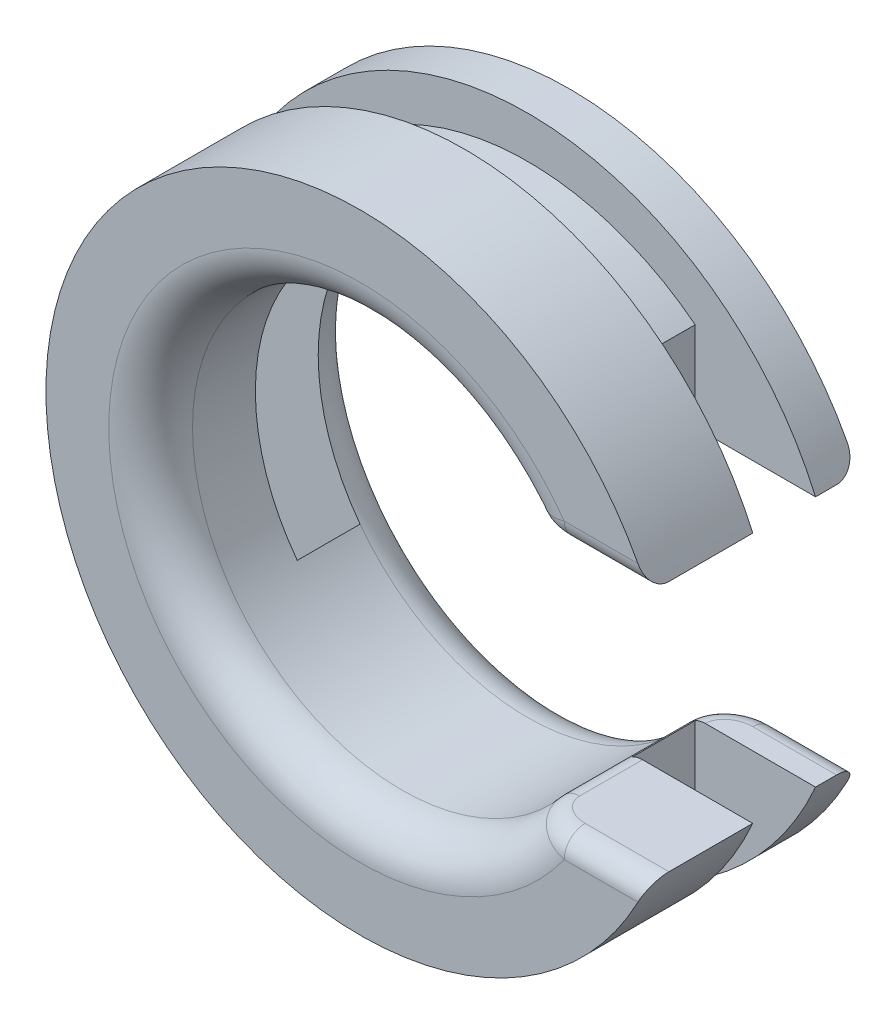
ISO-10303-21;
HEADER;
FILE_DESCRIPTION(('STEP AP214'),'2;1');
FILE_NAME('part.step','',(''),(''),'','','');
FILE_SCHEMA(('AUTOMOTIVE_DESIGN { 1 0 10303 214 1 1 1 1 }'));
ENDSEC;
DATA;
#1=APPLICATION_CONTEXT('core data for automotive mechanical design processes');
#2=APPLICATION_PROTOCOL_DEFINITION('international standard','automotive_design',2000,#1);
#3=PRODUCT_CONTEXT('',#1,'mechanical');
#4=PRODUCT('Part','Part','',(#3));
#5=PRODUCT_RELATED_PRODUCT_CATEGORY('part','',(#4));
#6=PRODUCT_DEFINITION_FORMATION('','',#4);
#7=PRODUCT_DEFINITION_CONTEXT('part definition',#1,'design');
#8=PRODUCT_DEFINITION('design','',#6,#7);
#9=PRODUCT_DEFINITION_SHAPE('','',#8);
#10=(LENGTH_UNIT() NAMED_UNIT(*) SI_UNIT(.MILLI.,.METRE.));
#11=(NAMED_UNIT(*) PLANE_ANGLE_UNIT() SI_UNIT($,.RADIAN.));
#12=(NAMED_UNIT(*) SI_UNIT($,.STERADIAN.) SOLID_ANGLE_UNIT());
#13=UNCERTAINTY_MEASURE_WITH_UNIT(LENGTH_MEASURE(1.E-05),#10,'distance_accuracy_value','');
#14=(GEOMETRIC_REPRESENTATION_CONTEXT(3) GLOBAL_UNCERTAINTY_ASSIGNED_CONTEXT((#13)) GLOBAL_UNIT_ASSIGNED_CONTEXT((#10,
#11,#12)) REPRESENTATION_CONTEXT('',''));
#15=CARTESIAN_POINT('',(0.,0.,0.));
#16=DIRECTION('',(0.,0.,1.));
#17=DIRECTION('',(1.,0.,0.));
#18=AXIS2_PLACEMENT_3D('',#15,#16,#17);
#19=CARTESIAN_POINT('',(0.,0.,0.));
#20=DIRECTION('',(0.,0.,1.));
#21=DIRECTION('',(1.,0.,0.));
#22=AXIS2_PLACEMENT_3D('',#19,#20,#21);
#23=CYLINDRICAL_SURFACE('',#22,41.275);
#24=CARTESIAN_POINT('',(0.,0.,-9.52499999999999));
#25=DIRECTION('',(0.,0.,1.));
#26=DIRECTION('',(1.,0.,0.));
#27=AXIS2_PLACEMENT_3D('',#24,#25,#26);
#28=CIRCLE('',#27,41.275);
#29=CARTESIAN_POINT('',(25.4,32.5340686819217,-9.52499999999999));
#30=VERTEX_POINT('',#29);
#31=CARTESIAN_POINT('',(-25.4,32.5340686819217,-9.52499999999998));
#32=VERTEX_POINT('',#31);
#33=EDGE_CURVE('E265',#30,#32,#28,.T.);
#34=ORIENTED_EDGE('',*,*,#33,.T.);
#35=DIRECTION('',(0.,0.,1.));
#36=VECTOR('',#35,1.);
#37=CARTESIAN_POINT('',(-25.4,32.5340686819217,0.));
#38=LINE('',#37,#36);
#39=CARTESIAN_POINT('',(-25.4,32.5340686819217,0.));
#40=VERTEX_POINT('',#39);
#41=EDGE_CURVE('E212',#32,#40,#38,.T.);
#42=ORIENTED_EDGE('',*,*,#41,.T.);
#43=CARTESIAN_POINT('',(0.,0.,0.));
#44=DIRECTION('',(0.,0.,1.));
#45=DIRECTION('',(1.,0.,0.));
#46=AXIS2_PLACEMENT_3D('',#43,#44,#45);
#47=CIRCLE('',#46,41.275);
#48=CARTESIAN_POINT('',(25.4,32.5340686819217,0.));
#49=VERTEX_POINT('',#48);
#50=EDGE_CURVE('E262',#49,#40,#47,.T.);
#51=ORIENTED_EDGE('',*,*,#50,.F.);
#52=DIRECTION('',(0.,0.,1.));
#53=VECTOR('',#52,1.);
#54=CARTESIAN_POINT('',(25.4,32.5340686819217,0.));
#55=LINE('',#54,#53);
#56=EDGE_CURVE('E229',#49,#30,#55,.F.);
#57=ORIENTED_EDGE('',*,*,#56,.T.);
#58=EDGE_LOOP('',(#34,#42,#51,#57));
#59=FACE_BOUND('',#58,.T.);
#60=ADVANCED_FACE('F35',(#59),#23,.T.);
#61=CARTESIAN_POINT('',(47.625,-19.05,-15.875));
#62=DIRECTION('',(0.,-1.,0.));
#63=DIRECTION('',(1.,0.,0.));
#64=AXIS2_PLACEMENT_3D('',#61,#62,#63);
#65=PLANE('',#64);
#66=DIRECTION('',(1.,0.,0.));
#67=VECTOR('',#66,1.);
#68=CARTESIAN_POINT('',(0.,-19.05,0.));
#69=LINE('',#68,#67);
#70=CARTESIAN_POINT('',(26.9407683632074,-19.05,0.));
#71=VERTEX_POINT('',#70);
#72=CARTESIAN_POINT('',(43.6490334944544,-19.05,0.));
#73=VERTEX_POINT('',#72);
#74=EDGE_CURVE('E245',#71,#73,#69,.T.);
#75=ORIENTED_EDGE('',*,*,#74,.F.);
#76=DIRECTION('',(0.,0.,1.));
#77=VECTOR('',#76,1.);
#78=CARTESIAN_POINT('',(26.9407683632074,-19.05,-15.875));
#79=LINE('',#78,#77);
#80=CARTESIAN_POINT('',(26.9407683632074,-19.05,9.52500000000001));
#81=VERTEX_POINT('',#80);
#82=EDGE_CURVE('E575',#71,#81,#79,.T.);
#83=ORIENTED_EDGE('',*,*,#82,.T.);
#84=CARTESIAN_POINT('',(32.5335720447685,-19.05,12.4215212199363));
#85=CARTESIAN_POINT('',(33.9298119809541,-19.05,16.1882103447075));
#86=CARTESIAN_POINT('',(33.6072573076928,-22.9584778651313,15.3180424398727));
#87=CARTESIAN_POINT('',(32.4066961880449,-19.05,12.4685349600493));
#88=CARTESIAN_POINT('',(33.6591978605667,-19.05,16.2079186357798));
#89=CARTESIAN_POINT('',(33.3925408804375,-22.9013353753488,15.4120699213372));
#90=CARTESIAN_POINT('',(32.2776849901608,-19.05,12.5094575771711));
#91=CARTESIAN_POINT('',(33.391387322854,-19.05,16.2141514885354));
#92=CARTESIAN_POINT('',(33.1746841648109,-22.8428760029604,15.4939151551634));
#93=CARTESIAN_POINT('',(32.0165421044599,-19.05,12.5793113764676));
#94=CARTESIAN_POINT('',(32.8686159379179,-19.05,16.2020481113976));
#95=CARTESIAN_POINT('',(32.7347302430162,-22.7237884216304,15.633622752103));
#96=CARTESIAN_POINT('',(31.8844125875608,-19.05,12.6082506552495));
#97=CARTESIAN_POINT('',(32.6133864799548,-19.05,16.1842749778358));
#98=CARTESIAN_POINT('',(32.5126360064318,-22.6631617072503,15.6915013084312));
#99=CARTESIAN_POINT('',(31.4856341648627,-19.05,12.6773188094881));
#100=CARTESIAN_POINT('',(31.8760982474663,-19.05,16.1006690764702));
#101=CARTESIAN_POINT('',(31.8439965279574,-22.4789901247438,15.8296376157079));
#102=CARTESIAN_POINT('',(31.2157945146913,-19.05,12.6999869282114));
#103=CARTESIAN_POINT('',(31.402929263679,-19.05,16.0054110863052));
#104=CARTESIAN_POINT('',(31.3937380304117,-22.3527937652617,15.8749738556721));
#105=CARTESIAN_POINT('',(30.6766392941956,-19.05,12.7000130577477));
#106=CARTESIAN_POINT('',(30.507703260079,-19.05,15.7498664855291));
#107=CARTESIAN_POINT('',(30.4988869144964,-22.0973435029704,15.8750261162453));
#108=CARTESIAN_POINT('',(30.4073234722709,-19.05,12.6774197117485));
#109=CARTESIAN_POINT('',(30.0830361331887,-19.05,15.5919940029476));
#110=CARTESIAN_POINT('',(30.054288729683,-21.9680930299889,15.8298394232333));
#111=CARTESIAN_POINT('',(29.8756164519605,-19.05,12.587841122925));
#112=CARTESIAN_POINT('',(29.2807476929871,-19.05,15.2213826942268));
#113=CARTESIAN_POINT('',(29.1813971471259,-21.7097076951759,15.6506822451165));
#114=CARTESIAN_POINT('',(29.6132375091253,-19.05,12.5207821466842));
#115=CARTESIAN_POINT('',(28.9006995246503,-19.05,15.0100871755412));
#116=CARTESIAN_POINT('',(28.7531320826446,-21.5805733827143,15.5165642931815));
#117=CARTESIAN_POINT('',(29.102395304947,-19.05,12.3417494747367));
#118=CARTESIAN_POINT('',(28.1864980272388,-19.05,14.5361930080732));
#119=CARTESIAN_POINT('',(27.9240071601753,-21.3262083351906,15.1584989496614));
#120=CARTESIAN_POINT('',(28.854023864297,-19.05,12.2295116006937));
#121=CARTESIAN_POINT('',(27.8500871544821,-19.05,14.2741939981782));
#122=CARTESIAN_POINT('',(27.5233250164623,-21.201005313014,14.9340232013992));
#123=CARTESIAN_POINT('',(28.3834276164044,-19.05,11.9596531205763));
#124=CARTESIAN_POINT('',(27.2303385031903,-19.05,13.7009779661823));
#125=CARTESIAN_POINT('',(26.7682965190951,-20.9612942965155,14.3943062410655));
#126=CARTESIAN_POINT('',(28.1611326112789,-19.05,11.8021584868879));
#127=CARTESIAN_POINT('',(26.9444050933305,-19.05,13.3902731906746));
#128=CARTESIAN_POINT('',(26.4138254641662,-20.8467577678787,14.0793169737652));
#129=CARTESIAN_POINT('',(27.8279577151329,-19.05,11.505729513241));
#130=CARTESIAN_POINT('',(26.5235266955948,-19.05,12.8364434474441));
#131=CARTESIAN_POINT('',(25.8850865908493,-20.6736369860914,13.4864590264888));
#132=CARTESIAN_POINT('',(27.7054242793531,-19.05,11.3798197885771));
#133=CARTESIAN_POINT('',(26.3710567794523,-19.05,12.6093505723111));
#134=CARTESIAN_POINT('',(25.6913404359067,-20.6095607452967,13.2346395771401));
#135=CARTESIAN_POINT('',(27.4821163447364,-19.05,11.1098862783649));
#136=CARTESIAN_POINT('',(26.0963082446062,-19.05,12.1354091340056));
#137=CARTESIAN_POINT('',(25.3392101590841,-20.4922522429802,12.6947725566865));
#138=CARTESIAN_POINT('',(27.3813184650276,-19.05,10.9658822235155));
#139=CARTESIAN_POINT('',(25.9733093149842,-19.05,11.8882528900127));
#140=CARTESIAN_POINT('',(25.1807880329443,-20.4390083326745,12.4067644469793));
#141=CARTESIAN_POINT('',(27.2204155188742,-19.05,10.6850364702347));
#142=CARTESIAN_POINT('',(25.7785724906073,-19.05,11.4150687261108));
#143=CARTESIAN_POINT('',(24.9284193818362,-20.3537319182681,11.8450729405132));
#144=CARTESIAN_POINT('',(27.1564623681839,-19.05,10.5504029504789));
#145=CARTESIAN_POINT('',(25.7015857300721,-19.05,11.191378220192));
#146=CARTESIAN_POINT('',(24.8283463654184,-20.3197096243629,11.5758059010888));
#147=CARTESIAN_POINT('',(27.0519988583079,-19.05,10.2724281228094));
#148=CARTESIAN_POINT('',(25.5765402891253,-19.05,10.7346156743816));
#149=CARTESIAN_POINT('',(24.6650704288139,-20.2640355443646,11.0198562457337));
#150=CARTESIAN_POINT('',(27.0114399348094,-19.05,10.1291055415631));
#151=CARTESIAN_POINT('',(25.5281147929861,-19.05,10.5010647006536));
#152=CARTESIAN_POINT('',(24.6017911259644,-20.2423581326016,10.7332110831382));
#153=CARTESIAN_POINT('',(26.9695996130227,-19.05,9.90791121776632));
#154=CARTESIAN_POINT('',(25.478308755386,-19.05,10.1426319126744));
#155=CARTESIAN_POINT('',(24.5365427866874,-20.2199797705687,10.2908224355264));
#156=CARTESIAN_POINT('',(26.9588094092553,-19.05,9.83173697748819));
#157=CARTESIAN_POINT('',(25.4654826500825,-19.05,10.0195476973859));
#158=CARTESIAN_POINT('',(24.5197237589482,-20.2142044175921,10.1384739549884));
#159=CARTESIAN_POINT('',(26.9443950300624,-19.05,9.67870707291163));
#160=CARTESIAN_POINT('',(25.4483656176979,-19.05,9.77268511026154));
#161=CARTESIAN_POINT('',(24.4972580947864,-20.2064879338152,9.83241414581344));
#162=CARTESIAN_POINT('',(26.9407692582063,-19.05,9.60185156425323));
#163=CARTESIAN_POINT('',(25.4440601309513,-19.05,9.64881628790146));
#164=CARTESIAN_POINT('',(24.4916089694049,-20.204545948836,9.6787031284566));
#165=CARTESIAN_POINT('',(26.9407674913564,-19.05,9.45013608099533));
#166=CARTESIAN_POINT('',(25.4440579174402,-19.05,9.40438603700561));
#167=CARTESIAN_POINT('',(24.491606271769,-20.204544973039,9.37527216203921));
#168=CARTESIAN_POINT('',(26.9442064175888,-19.05,9.3752759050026));
#169=CARTESIAN_POINT('',(25.4481413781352,-19.05,9.28373525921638));
#170=CARTESIAN_POINT('',(24.4969643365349,-20.2063868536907,9.22555181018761));
#171=CARTESIAN_POINT('',(26.9578955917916,-19.05,9.22613229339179));
#172=CARTESIAN_POINT('',(25.4643971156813,-19.05,9.04315776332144));
#173=CARTESIAN_POINT('',(24.5182993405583,-20.2137153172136,8.92726458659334));
#174=CARTESIAN_POINT('',(26.9681501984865,-19.05,9.15184925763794));
#175=CARTESIAN_POINT('',(25.4765860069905,-19.05,8.92314750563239));
#176=CARTESIAN_POINT('',(24.5342830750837,-20.2192042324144,8.7786985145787));
#177=CARTESIAN_POINT('',(26.9953594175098,-19.05,9.00411189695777));
#178=CARTESIAN_POINT('',(25.5089485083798,-19.05,8.68397184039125));
#179=CARTESIAN_POINT('',(24.5767136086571,-20.2337577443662,8.4832237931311));
#180=CARTESIAN_POINT('',(27.0123500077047,-19.05,8.93066423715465));
#181=CARTESIAN_POINT('',(25.529187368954,-19.05,8.56473447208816));
#182=CARTESIAN_POINT('',(24.6032165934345,-20.242841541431,8.33632847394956));
#183=CARTESIAN_POINT('',(27.0526876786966,-19.05,8.78559428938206));
#184=CARTESIAN_POINT('',(25.5772893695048,-19.05,8.32844139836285));
#185=CARTESIAN_POINT('',(24.6661806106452,-20.2643845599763,8.04618857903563));
#186=CARTESIAN_POINT('',(27.0760298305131,-19.05,8.71397063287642));
#187=CARTESIAN_POINT('',(25.6051786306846,-19.05,8.21130973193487));
#188=CARTESIAN_POINT('',(24.70263392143,-20.2768411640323,7.90294126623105));
#189=CARTESIAN_POINT('',(27.102390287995,-19.05,8.6434937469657));
#190=CARTESIAN_POINT('',(25.6366898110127,-19.05,8.09569123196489));
#191=CARTESIAN_POINT('',(24.7438320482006,-20.2908917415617,7.7619874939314));
#192=(BOUNDED_SURFACE() B_SPLINE_SURFACE(3,2,((#84,#85,#86),(#87,#88,#89),(#90,#91,#92),(#93,
#94,#95),(#96,#97,#98),(#99,#100,#101),(#102,#103,#104),(#105,#106,#107),(#108,#109,#110),(#111,
#112,#113),(#114,#115,#116),(#117,#118,#119),(#120,#121,#122),(#123,#124,#125),(#126,#127,#128),
(#129,#130,#131),(#132,#133,#134),(#135,#136,#137),(#138,#139,#140),(#141,#142,#143),(#144,#145,
#146),(#147,#148,#149),(#150,#151,#152),(#153,#154,#155),(#156,#157,#158),(#159,#160,#161),
(#162,#163,#164),(#165,#166,#167),(#168,#169,#170),(#171,#172,#173),(#174,#175,#176),(#177,#178,
#179),(#180,#181,#182),(#183,#184,#185),(#186,#187,#188),(#189,#190,#191)),.UNSPECIFIED.,.F.,
.F.,.F.) B_SPLINE_SURFACE_WITH_KNOTS((4,2,2,2,2,2,2,2,2,2,2,2,2,2,2,2,2,4),(3,3),(0.,
0.405564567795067,0.810854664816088,1.61891710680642,2.42611157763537,3.23464790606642,
4.04798237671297,4.85907450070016,5.38427922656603,5.90891614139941,6.35424256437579,
6.79864117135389,7.0291607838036,7.25962902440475,7.48413656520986,7.70878782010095,
7.93465549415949,8.1603483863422),(0.,1.),
.UNSPECIFIED.) GEOMETRIC_REPRESENTATION_ITEM() RATIONAL_B_SPLINE_SURFACE(((1.,0.620073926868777,
1.),(1.,0.627331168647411,1.),(1.,0.63462611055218,1.),(1.,0.649233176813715,1.),(1.,
0.65654528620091,1.),(1.,0.67838968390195,1.),(1.,0.692875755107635,1.),(1.,0.721322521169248,
1.),(1.,0.735283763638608,1.),(1.,0.762451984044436,1.),(1.,0.775657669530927,1.),(1.,
0.801064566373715,1.),(1.,0.813259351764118,1.),(1.,0.836145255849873,1.),(1.,0.846840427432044,
1.),(1.,0.862756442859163,1.),(1.,0.868578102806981,1.),(1.,0.879148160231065,1.),(1.,
0.883897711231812,1.),(1.,0.891459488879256,1.),(1.,0.894456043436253,1.),(1.,0.899343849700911,
1.),(1.,0.901237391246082,1.),(1.,0.903189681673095,1.),(1.,0.903692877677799,1.),(1.,
0.904364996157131,1.),(1.,0.904533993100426,1.),(1.,0.904534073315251,1.),(1.,0.904373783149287,
1.),(1.,0.903735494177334,1.),(1.,0.903257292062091,1.),(1.,0.901987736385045,1.),(1.,
0.901194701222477,1.),(1.,0.899310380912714,1.),(1.,0.898219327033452,1.),(1.,0.896986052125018,1.))) REPRESENTATION_ITEM('') SURFACE());
#193=CARTESIAN_POINT('',(27.102390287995,-19.05,8.6434937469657));
#194=CARTESIAN_POINT('',(27.0760298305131,-19.05,8.71397063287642));
#195=CARTESIAN_POINT('',(27.0526876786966,-19.05,8.78559428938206));
#196=CARTESIAN_POINT('',(27.0123500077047,-19.05,8.93066423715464));
#197=CARTESIAN_POINT('',(26.9953594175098,-19.05,9.00411189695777));
#198=CARTESIAN_POINT('',(26.9681501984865,-19.05,9.15184925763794));
#199=CARTESIAN_POINT('',(26.9578955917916,-19.05,9.22613229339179));
#200=CARTESIAN_POINT('',(26.9442064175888,-19.05,9.3752759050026));
#201=CARTESIAN_POINT('',(26.9407674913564,-19.05,9.45013608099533));
#202=CARTESIAN_POINT('',(26.9407692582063,-19.05,9.60185156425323));
#203=CARTESIAN_POINT('',(26.9443950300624,-19.05,9.67870707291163));
#204=CARTESIAN_POINT('',(26.9588094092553,-19.05,9.83173697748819));
#205=CARTESIAN_POINT('',(26.9695996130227,-19.05,9.90791121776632));
#206=CARTESIAN_POINT('',(27.0114399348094,-19.05,10.1291055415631));
#207=CARTESIAN_POINT('',(27.0519988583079,-19.05,10.2724281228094));
#208=CARTESIAN_POINT('',(27.1564623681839,-19.05,10.5504029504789));
#209=CARTESIAN_POINT('',(27.2204155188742,-19.05,10.6850364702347));
#210=CARTESIAN_POINT('',(27.3813184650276,-19.05,10.9658822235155));
#211=CARTESIAN_POINT('',(27.4821163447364,-19.05,11.1098862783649));
#212=CARTESIAN_POINT('',(27.7054242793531,-19.05,11.3798197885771));
#213=CARTESIAN_POINT('',(27.8279577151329,-19.05,11.505729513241));
#214=CARTESIAN_POINT('',(28.1611326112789,-19.05,11.8021584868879));
#215=CARTESIAN_POINT('',(28.3834276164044,-19.05,11.9596531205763));
#216=CARTESIAN_POINT('',(28.854023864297,-19.05,12.2295116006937));
#217=CARTESIAN_POINT('',(29.102395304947,-19.05,12.3417494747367));
#218=CARTESIAN_POINT('',(29.6132375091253,-19.05,12.5207821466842));
#219=CARTESIAN_POINT('',(29.8756164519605,-19.05,12.587841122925));
#220=CARTESIAN_POINT('',(30.4073234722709,-19.05,12.6774197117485));
#221=CARTESIAN_POINT('',(30.6766392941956,-19.05,12.7000130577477));
#222=CARTESIAN_POINT('',(31.2157945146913,-19.05,12.6999869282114));
#223=CARTESIAN_POINT('',(31.4856341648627,-19.05,12.6773188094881));
#224=CARTESIAN_POINT('',(31.8844125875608,-19.05,12.6082506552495));
#225=CARTESIAN_POINT('',(32.0165421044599,-19.05,12.5793113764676));
#226=CARTESIAN_POINT('',(32.2776849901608,-19.05,12.5094575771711));
#227=CARTESIAN_POINT('',(32.4066961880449,-19.05,12.4685349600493));
#228=CARTESIAN_POINT('',(32.5335720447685,-19.05,12.4215212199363));
#229=B_SPLINE_CURVE_WITH_KNOTS('',3,(#193,#194,#195,#196,#197,#198,#199,#200,#201,#202,#203,
#204,#205,#206,#207,#208,#209,#210,#211,#212,#213,#214,#215,#216,#217,#218,#219,#220,#221,#222,
#223,#224,#225,#226,#227,#228),.UNSPECIFIED.,.F.,.F.,(4,2,2,2,2,2,2,2,2,2,2,2,2,2,2,2,2,4),(0.,
0.225692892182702,0.451560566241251,0.676211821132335,0.900719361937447,1.1311876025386,
1.36170721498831,1.80610582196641,2.25143224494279,2.77606915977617,3.30127388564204,
4.11236600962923,4.92570048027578,5.73423680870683,6.54143127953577,7.34949372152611,
7.75478381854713,8.1603483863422),.UNSPECIFIED.);
#230=CARTESIAN_POINT('',(30.9460720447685,-19.05,12.7));
#231=VERTEX_POINT('',#230);
#232=EDGE_CURVE('E509',#81,#231,#229,.T.);
#233=ORIENTED_EDGE('',*,*,#232,.T.);
#234=DIRECTION('',(1.,0.,0.));
#235=VECTOR('',#234,1.);
#236=CARTESIAN_POINT('',(47.625,-19.05,12.7));
#237=LINE('',#236,#235);
#238=CARTESIAN_POINT('',(43.6490334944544,-19.05,12.7));
#239=VERTEX_POINT('',#238);
#240=EDGE_CURVE('E516',#231,#239,#237,.T.);
#241=ORIENTED_EDGE('',*,*,#240,.T.);
#242=DIRECTION('',(0.,0.,1.));
#243=VECTOR('',#242,1.);
#244=CARTESIAN_POINT('',(43.6490334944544,-19.05,0.));
#245=LINE('',#244,#243);
#246=EDGE_CURVE('E248',#73,#239,#245,.T.);
#247=ORIENTED_EDGE('',*,*,#246,.F.);
#248=EDGE_LOOP('',(#75,#83,#233,#241,#247));
#249=FACE_BOUND('',#248,.T.);
#250=ADVANCED_FACE('F574',(#249),#65,.F.);
#251=CARTESIAN_POINT('',(47.625,19.05,-15.875));
#252=DIRECTION('',(0.,1.,0.));
#253=DIRECTION('',(-1.,0.,0.));
#254=AXIS2_PLACEMENT_3D('',#251,#252,#253);
#255=PLANE('',#254);
#256=DIRECTION('',(0.,0.,1.));
#257=VECTOR('',#256,1.);
#258=CARTESIAN_POINT('',(26.9407683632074,19.05,-15.875));
#259=LINE('',#258,#257);
#260=CARTESIAN_POINT('',(26.9407683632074,19.05,9.52500000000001));
#261=VERTEX_POINT('',#260);
#262=CARTESIAN_POINT('',(26.9407683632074,19.05,0.));
#263=VERTEX_POINT('',#262);
#264=EDGE_CURVE('E549',#261,#263,#259,.F.);
#265=ORIENTED_EDGE('',*,*,#264,.T.);
#266=DIRECTION('',(-1.,0.,0.));
#267=VECTOR('',#266,1.);
#268=CARTESIAN_POINT('',(0.,19.05,0.));
#269=LINE('',#268,#267);
#270=CARTESIAN_POINT('',(43.6490334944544,19.05,0.));
#271=VERTEX_POINT('',#270);
#272=EDGE_CURVE('E257',#271,#263,#269,.T.);
#273=ORIENTED_EDGE('',*,*,#272,.F.);
#274=DIRECTION('',(0.,0.,1.));
#275=VECTOR('',#274,1.);
#276=CARTESIAN_POINT('',(43.6490334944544,19.05,0.));
#277=LINE('',#276,#275);
#278=CARTESIAN_POINT('',(43.6490334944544,19.05,12.7));
#279=VERTEX_POINT('',#278);
#280=EDGE_CURVE('E259',#279,#271,#277,.F.);
#281=ORIENTED_EDGE('',*,*,#280,.F.);
#282=DIRECTION('',(-1.,0.,0.));
#283=VECTOR('',#282,1.);
#284=CARTESIAN_POINT('',(47.625,19.05,12.7));
#285=LINE('',#284,#283);
#286=CARTESIAN_POINT('',(30.9460720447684,19.05,12.7));
#287=VERTEX_POINT('',#286);
#288=EDGE_CURVE('E557',#279,#287,#285,.T.);
#289=ORIENTED_EDGE('',*,*,#288,.T.);
#290=CARTESIAN_POINT('',(27.102390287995,19.05,8.6434937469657));
#291=CARTESIAN_POINT('',(25.6366898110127,19.05,8.09569123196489));
#292=CARTESIAN_POINT('',(24.7438320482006,20.2908917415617,7.76198749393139));
#293=CARTESIAN_POINT('',(27.0760592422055,19.05,8.71389221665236));
#294=CARTESIAN_POINT('',(25.6052137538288,19.05,8.21118127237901));
#295=CARTESIAN_POINT('',(24.7026798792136,20.2768568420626,7.90278443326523));
#296=CARTESIAN_POINT('',(27.0527397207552,19.05,8.78543477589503));
#297=CARTESIAN_POINT('',(25.5773514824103,19.05,8.32818085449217));
#298=CARTESIAN_POINT('',(24.6662618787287,20.2644123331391,8.04586955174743));
#299=CARTESIAN_POINT('',(27.0124416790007,19.05,8.93030710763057));
#300=CARTESIAN_POINT('',(25.5292965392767,19.05,8.56415407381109));
#301=CARTESIAN_POINT('',(24.6033596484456,20.2428905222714,8.3356142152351));
#302=CARTESIAN_POINT('',(26.9954652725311,19.05,9.00363746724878));
#303=CARTESIAN_POINT('',(25.5090744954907,19.05,8.68320236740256));
#304=CARTESIAN_POINT('',(24.5768787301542,20.2338143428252,8.48227493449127));
#305=CARTESIAN_POINT('',(26.9682267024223,19.05,9.15133448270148));
#306=CARTESIAN_POINT('',(25.4766769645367,19.05,8.92231538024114));
#307=CARTESIAN_POINT('',(24.534402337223,20.2192451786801,8.77766896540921));
#308=CARTESIAN_POINT('',(26.9579462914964,19.05,9.22569775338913));
#309=CARTESIAN_POINT('',(25.4644573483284,19.05,9.04245620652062));
#310=CARTESIAN_POINT('',(24.5183783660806,20.2137424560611,8.9263955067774));
#311=CARTESIAN_POINT('',(26.9442173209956,19.05,9.37503986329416));
#312=CARTESIAN_POINT('',(25.4481543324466,19.05,9.28335476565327));
#313=CARTESIAN_POINT('',(24.4969813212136,20.2063926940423,9.22507972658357));
#314=CARTESIAN_POINT('',(26.9407676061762,19.05,9.45001859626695));
#315=CARTESIAN_POINT('',(25.4440580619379,19.05,9.40419675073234));
#316=CARTESIAN_POINT('',(24.491606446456,20.2045450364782,9.37503719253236));
#317=CARTESIAN_POINT('',(26.9407691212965,19.05,9.600086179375));
#318=CARTESIAN_POINT('',(25.4440599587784,19.05,9.64597206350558));
#319=CARTESIAN_POINT('',(24.4916087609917,20.204545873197,9.67517235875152));
#320=CARTESIAN_POINT('',(26.9442300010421,19.05,9.6751750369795));
#321=CARTESIAN_POINT('',(25.4481695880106,19.05,9.76699151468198));
#322=CARTESIAN_POINT('',(24.4970009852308,20.2063995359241,9.82535007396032));
#323=CARTESIAN_POINT('',(26.9579930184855,19.05,9.82473308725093));
#324=CARTESIAN_POINT('',(25.4645126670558,19.05,10.0082394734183));
#325=CARTESIAN_POINT('',(24.5184512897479,20.2137674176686,10.1244661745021));
#326=CARTESIAN_POINT('',(26.9682980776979,19.05,9.89920200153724));
#327=CARTESIAN_POINT('',(25.4767611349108,19.05,10.1285522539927));
#328=CARTESIAN_POINT('',(24.5345139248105,20.2192831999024,10.2734040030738));
#329=CARTESIAN_POINT('',(27.0092173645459,19.05,10.120631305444));
#330=CARTESIAN_POINT('',(25.5254671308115,19.05,10.4872897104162));
#331=CARTESIAN_POINT('',(24.5983234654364,20.2411702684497,10.7162626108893));
#332=CARTESIAN_POINT('',(27.0498365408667,19.05,10.2658523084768));
#333=CARTESIAN_POINT('',(25.5739610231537,19.05,10.7238754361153));
#334=CARTESIAN_POINT('',(24.6616932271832,20.2628817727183,11.0067046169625));
#335=CARTESIAN_POINT('',(27.1546722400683,19.05,10.5464327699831));
#336=CARTESIAN_POINT('',(25.6994363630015,19.05,11.1848073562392));
#337=CARTESIAN_POINT('',(24.825546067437,20.3187568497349,11.5678655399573));
#338=CARTESIAN_POINT('',(27.2187656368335,19.05,10.6818393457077));
#339=CARTESIAN_POINT('',(25.7765844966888,19.05,11.4097327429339));
#340=CARTESIAN_POINT('',(24.9258355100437,20.3528554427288,11.8386786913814));
#341=CARTESIAN_POINT('',(27.3670113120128,19.05,10.9412214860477));
#342=CARTESIAN_POINT('',(25.9558670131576,19.05,11.8463704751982));
#343=CARTESIAN_POINT('',(25.1583441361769,20.4314277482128,12.3574429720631));
#344=CARTESIAN_POINT('',(27.4511832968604,19.05,11.0651856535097));
#345=CARTESIAN_POINT('',(26.0584178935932,19.05,12.0584370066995));
#346=CARTESIAN_POINT('',(25.2905946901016,20.4759116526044,12.605371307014));
#347=CARTESIAN_POINT('',(27.6667431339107,19.05,11.3392265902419));
#348=CARTESIAN_POINT('',(26.3232821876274,19.05,12.5368532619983));
#349=CARTESIAN_POINT('',(25.6302095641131,20.589316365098,13.153453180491));
#350=CARTESIAN_POINT('',(27.8045236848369,19.05,11.4842753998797));
#351=CARTESIAN_POINT('',(26.4944426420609,19.05,12.7972250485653));
#352=CARTESIAN_POINT('',(25.8479268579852,20.6614439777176,13.4435507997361));
#353=CARTESIAN_POINT('',(28.1018555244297,19.05,11.7500017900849));
#354=CARTESIAN_POINT('',(26.8684339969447,19.05,13.2912318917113));
#355=CARTESIAN_POINT('',(26.3197262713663,20.8159726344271,13.9750035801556));
#356=CARTESIAN_POINT('',(28.261441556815,19.05,11.8706396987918));
#357=CARTESIAN_POINT('',(27.0723359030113,19.05,13.5250106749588));
#358=CARTESIAN_POINT('',(26.5738664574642,20.8983900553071,14.2162793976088));
#359=CARTESIAN_POINT('',(28.6372888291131,19.05,12.1137187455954));
#360=CARTESIAN_POINT('',(27.5616317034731,19.05,14.0210357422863));
#361=CARTESIAN_POINT('',(27.1750344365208,21.0909381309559,14.7024374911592));
#362=CARTESIAN_POINT('',(28.8578879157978,19.05,12.2294451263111));
#363=CARTESIAN_POINT('',(27.855110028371,19.05,14.2748023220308));
#364=CARTESIAN_POINT('',(27.5296113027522,21.2029300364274,14.9338902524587));
#365=CARTESIAN_POINT('',(29.3148916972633,19.05,12.4231765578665));
#366=CARTESIAN_POINT('',(28.4793879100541,19.05,14.7417742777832));
#367=CARTESIAN_POINT('',(28.2682737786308,21.4324057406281,15.321353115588));
#368=CARTESIAN_POINT('',(29.5512996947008,19.05,12.5011736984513));
#369=CARTESIAN_POINT('',(28.81208617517,19.05,14.9544031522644));
#370=CARTESIAN_POINT('',(28.652365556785,21.5498906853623,15.4773473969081));
#371=CARTESIAN_POINT('',(29.9809294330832,19.05,12.6067973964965));
#372=CARTESIAN_POINT('',(29.4353580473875,19.05,15.2948611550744));
#373=CARTESIAN_POINT('',(29.3541644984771,21.7609614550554,15.6885947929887));
#374=CARTESIAN_POINT('',(30.1724082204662,19.05,12.6416765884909));
#375=CARTESIAN_POINT('',(29.7221435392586,19.05,15.4314639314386));
#376=CARTESIAN_POINT('',(29.6682207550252,21.8542092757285,15.7583531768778));
#377=CARTESIAN_POINT('',(30.557903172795,19.05,12.6882693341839));
#378=CARTESIAN_POINT('',(30.3182255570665,19.05,15.6765022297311));
#379=CARTESIAN_POINT('',(30.3030546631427,22.0402337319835,15.851538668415));
#380=CARTESIAN_POINT('',(30.7519162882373,19.05,12.700008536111));
#381=CARTESIAN_POINT('',(30.6284379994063,19.05,15.7843218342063));
#382=CARTESIAN_POINT('',(30.623824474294,22.1330107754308,15.8750170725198));
#383=CARTESIAN_POINT('',(31.2153635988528,19.05,12.6999881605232));
#384=CARTESIAN_POINT('',(31.4021736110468,19.05,16.0052078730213));
#385=CARTESIAN_POINT('',(31.3930253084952,22.3525878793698,15.8749763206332));
#386=CARTESIAN_POINT('',(31.4849295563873,19.05,12.677376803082));
#387=CARTESIAN_POINT('',(31.8748342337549,19.05,16.1004138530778));
#388=CARTESIAN_POINT('',(31.8428213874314,22.4786602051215,15.8297536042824));
#389=CARTESIAN_POINT('',(31.8835978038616,19.05,12.6084238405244));
#390=CARTESIAN_POINT('',(32.6118313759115,19.05,16.1841564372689));
#391=CARTESIAN_POINT('',(32.5112666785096,22.6627876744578,15.6918476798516));
#392=CARTESIAN_POINT('',(32.0159113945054,19.05,12.5794664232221));
#393=CARTESIAN_POINT('',(32.8673834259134,19.05,16.2019936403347));
#394=CARTESIAN_POINT('',(32.733668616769,22.723500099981,15.6339328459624));
#395=CARTESIAN_POINT('',(32.2773839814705,19.05,12.5095516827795));
#396=CARTESIAN_POINT('',(33.39076911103,19.05,16.214163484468));
#397=CARTESIAN_POINT('',(33.1741761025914,22.8427394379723,15.4941033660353));
#398=CARTESIAN_POINT('',(32.4065415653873,19.05,12.4685890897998));
#399=CARTESIAN_POINT('',(33.6588708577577,19.05,16.2079367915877));
#400=CARTESIAN_POINT('',(33.3922797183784,22.9012653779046,15.4121781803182));
#401=CARTESIAN_POINT('',(32.5335720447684,19.05,12.4215212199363));
#402=CARTESIAN_POINT('',(33.9298119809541,19.05,16.1882103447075));
#403=CARTESIAN_POINT('',(33.6072573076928,22.9584778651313,15.3180424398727));
#404=(BOUNDED_SURFACE() B_SPLINE_SURFACE(3,2,((#290,#291,#292),(#293,#294,#295),(#296,#297,
#298),(#299,#300,#301),(#302,#303,#304),(#305,#306,#307),(#308,#309,#310),(#311,#312,#313),
(#314,#315,#316),(#317,#318,#319),(#320,#321,#322),(#323,#324,#325),(#326,#327,#328),(#329,#330,
#331),(#332,#333,#334),(#335,#336,#337),(#338,#339,#340),(#341,#342,#343),(#344,#345,#346),
(#347,#348,#349),(#350,#351,#352),(#353,#354,#355),(#356,#357,#358),(#359,#360,#361),(#362,#363,
#364),(#365,#366,#367),(#368,#369,#370),(#371,#372,#373),(#374,#375,#376),(#377,#378,#379),
(#380,#381,#382),(#383,#384,#385),(#386,#387,#388),(#389,#390,#391),(#392,#393,#394),(#395,#396,
#397),(#398,#399,#400),(#401,#402,#403)),.UNSPECIFIED.,.F.,.F.,
.F.) B_SPLINE_SURFACE_WITH_KNOTS((4,2,2,2,2,2,2,2,2,2,2,2,2,2,2,2,2,2,4),(3,3),(0.,
0.225441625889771,0.450958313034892,0.675857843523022,0.900719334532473,1.12589503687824,
1.35116691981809,1.80100705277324,2.24852072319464,2.69647543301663,3.29341791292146,
3.89132286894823,4.63482766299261,5.37848827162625,5.96099815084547,6.54286201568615,
7.34989976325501,7.75575162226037,8.16178190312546),(0.,1.),
.UNSPECIFIED.) GEOMETRIC_REPRESENTATION_ITEM() RATIONAL_B_SPLINE_SURFACE(((1.,0.896986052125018,
1.),(1.,0.898217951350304,1.),(1.,0.899307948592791,1.),(1.,0.90119042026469,1.),(1.,
0.901982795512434,1.),(1.,0.903253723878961,1.),(1.,0.903733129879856,1.),(1.,0.904373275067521,
1.),(1.,0.904534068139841,1.),(1.,0.904533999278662,1.),(1.,0.904372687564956,1.),(1.,
0.903730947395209,1.),(1.,0.903250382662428,1.),(1.,0.901341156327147,1.),(1.,0.899444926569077,
1.),(1.,0.894539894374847,1.),(1.,0.891536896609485,1.),(1.,0.88457021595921,1.),(1.,
0.880605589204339,1.),(1.,0.870414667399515,1.),(1.,0.863874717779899,1.),(1.,0.849673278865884,
1.),(1.,0.84200999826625,1.),(1.,0.82382869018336,1.),(1.,0.813069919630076,1.),(1.,
0.790534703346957,1.),(1.,0.778758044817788,1.),(1.,0.757078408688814,1.),(1.,0.747322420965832,
1.),(1.,0.727458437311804,1.),(1.,0.71735084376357,1.),(1.,0.69289839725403,1.),(1.,
0.678427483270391,1.),(1.,0.656590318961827,1.),(1.,0.649268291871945,1.),(1.,0.634643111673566,
1.),(1.,0.627339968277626,1.),(1.,0.620073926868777,1.))) REPRESENTATION_ITEM('') SURFACE());
#405=CARTESIAN_POINT('',(32.5335720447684,19.05,12.4215212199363));
#406=CARTESIAN_POINT('',(32.4065415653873,19.05,12.4685890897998));
#407=CARTESIAN_POINT('',(32.2773839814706,19.05,12.5095516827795));
#408=CARTESIAN_POINT('',(32.0159113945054,19.05,12.5794664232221));
#409=CARTESIAN_POINT('',(31.8835978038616,19.05,12.6084238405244));
#410=CARTESIAN_POINT('',(31.4849295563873,19.05,12.677376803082));
#411=CARTESIAN_POINT('',(31.2153635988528,19.05,12.6999881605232));
#412=CARTESIAN_POINT('',(30.7519162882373,19.05,12.700008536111));
#413=CARTESIAN_POINT('',(30.557903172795,19.05,12.6882693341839));
#414=CARTESIAN_POINT('',(30.1724082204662,19.05,12.6416765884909));
#415=CARTESIAN_POINT('',(29.9809294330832,19.05,12.6067973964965));
#416=CARTESIAN_POINT('',(29.5512996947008,19.05,12.5011736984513));
#417=CARTESIAN_POINT('',(29.3148916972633,19.05,12.4231765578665));
#418=CARTESIAN_POINT('',(28.8578879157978,19.05,12.2294451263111));
#419=CARTESIAN_POINT('',(28.6372888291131,19.05,12.1137187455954));
#420=CARTESIAN_POINT('',(28.261441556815,19.05,11.8706396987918));
#421=CARTESIAN_POINT('',(28.1018555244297,19.05,11.7500017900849));
#422=CARTESIAN_POINT('',(27.8045236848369,19.05,11.4842753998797));
#423=CARTESIAN_POINT('',(27.6667431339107,19.05,11.3392265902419));
#424=CARTESIAN_POINT('',(27.4511832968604,19.05,11.0651856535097));
#425=CARTESIAN_POINT('',(27.3670113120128,19.05,10.9412214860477));
#426=CARTESIAN_POINT('',(27.2187656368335,19.05,10.6818393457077));
#427=CARTESIAN_POINT('',(27.1546722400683,19.05,10.5464327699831));
#428=CARTESIAN_POINT('',(27.0498365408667,19.05,10.2658523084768));
#429=CARTESIAN_POINT('',(27.0092173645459,19.05,10.120631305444));
#430=CARTESIAN_POINT('',(26.9682980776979,19.05,9.89920200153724));
#431=CARTESIAN_POINT('',(26.9579930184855,19.05,9.82473308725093));
#432=CARTESIAN_POINT('',(26.9442300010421,19.05,9.6751750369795));
#433=CARTESIAN_POINT('',(26.9407691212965,19.05,9.600086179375));
#434=CARTESIAN_POINT('',(26.9407676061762,19.05,9.45001859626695));
#435=CARTESIAN_POINT('',(26.9442173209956,19.05,9.37503986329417));
#436=CARTESIAN_POINT('',(26.9579462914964,19.05,9.22569775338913));
#437=CARTESIAN_POINT('',(26.9682267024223,19.05,9.15133448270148));
#438=CARTESIAN_POINT('',(26.9954652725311,19.05,9.00363746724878));
#439=CARTESIAN_POINT('',(27.0124416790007,19.05,8.93030710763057));
#440=CARTESIAN_POINT('',(27.0527397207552,19.05,8.78543477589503));
#441=CARTESIAN_POINT('',(27.0760592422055,19.05,8.71389221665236));
#442=CARTESIAN_POINT('',(27.102390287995,19.05,8.6434937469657));
#443=B_SPLINE_CURVE_WITH_KNOTS('',3,(#405,#406,#407,#408,#409,#410,#411,#412,#413,#414,#415,
#416,#417,#418,#419,#420,#421,#422,#423,#424,#425,#426,#427,#428,#429,#430,#431,#432,#433,#434,
#435,#436,#437,#438,#439,#440,#441,#442),.UNSPECIFIED.,.F.,.F.,(4,2,2,2,2,2,2,2,2,2,2,2,2,2,2,2,
2,2,4),(0.,0.406030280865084,0.811882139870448,1.61891988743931,2.20078375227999,
2.78329363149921,3.52695424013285,4.27045903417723,4.868363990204,5.46530647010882,
5.91326117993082,6.36077485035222,6.81061498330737,7.03588686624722,7.26106256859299,
7.48592405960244,7.71082359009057,7.93634027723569,8.16178190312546),.UNSPECIFIED.);
#444=EDGE_CURVE('E552',#287,#261,#443,.T.);
#445=ORIENTED_EDGE('',*,*,#444,.T.);
#446=EDGE_LOOP('',(#265,#273,#281,#289,#445));
#447=FACE_BOUND('',#446,.T.);
#448=ADVANCED_FACE('F330',(#447),#255,.F.);
#449=CARTESIAN_POINT('',(0.,0.,0.));
#450=DIRECTION('',(0.,0.,1.));
#451=DIRECTION('',(1.,0.,0.));
#452=AXIS2_PLACEMENT_3D('',#449,#450,#451);
#453=CYLINDRICAL_SURFACE('',#452,47.625);
#454=CARTESIAN_POINT('',(0.,0.,15.875));
#455=DIRECTION('',(0.,0.,1.));
#456=DIRECTION('',(1.,0.,0.));
#457=AXIS2_PLACEMENT_3D('',#454,#455,#456);
#458=CIRCLE('',#457,47.625);
#459=CARTESIAN_POINT('',(42.1211348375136,22.225,15.875));
#460=VERTEX_POINT('',#459);
#461=CARTESIAN_POINT('',(42.1211348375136,-22.225,15.875));
#462=VERTEX_POINT('',#461);
#463=EDGE_CURVE('E273',#460,#462,#458,.T.);
#464=ORIENTED_EDGE('',*,*,#463,.F.);
#465=CARTESIAN_POINT('',(42.1211348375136,22.225,15.875));
#466=CARTESIAN_POINT('',(42.1717621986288,22.1290545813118,15.8749950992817));
#467=CARTESIAN_POINT('',(42.2220400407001,22.0329677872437,15.8706492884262));
#468=CARTESIAN_POINT('',(42.3216339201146,21.8410529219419,15.8531745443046));
#469=CARTESIAN_POINT('',(42.3709496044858,21.7452249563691,15.840042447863));
#470=CARTESIAN_POINT('',(42.5173002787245,21.4584667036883,15.7872125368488));
#471=CARTESIAN_POINT('',(42.6124277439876,21.2688522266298,15.734079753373));
#472=CARTESIAN_POINT('',(42.7950668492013,20.8989360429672,15.5916277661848));
#473=CARTESIAN_POINT('',(42.8825580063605,20.7186598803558,15.502214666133));
#474=CARTESIAN_POINT('',(43.0057195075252,20.4611306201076,15.3419012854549));
#475=CARTESIAN_POINT('',(43.0454199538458,20.3774513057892,15.2841128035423));
#476=CARTESIAN_POINT('',(43.1218473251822,20.2152149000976,15.1600398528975));
#477=CARTESIAN_POINT('',(43.1585758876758,20.1366549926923,15.0937601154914));
#478=CARTESIAN_POINT('',(43.2258843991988,19.9917335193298,14.9587922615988));
#479=CARTESIAN_POINT('',(43.2567214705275,19.9248994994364,14.8907383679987));
#480=CARTESIAN_POINT('',(43.3153621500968,19.7970948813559,14.7481840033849));
#481=CARTESIAN_POINT('',(43.3431673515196,19.7361212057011,14.6736869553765));
#482=CARTESIAN_POINT('',(43.395536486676,19.6207048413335,14.5186842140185));
#483=CARTESIAN_POINT('',(43.4200993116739,19.5662643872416,14.4381764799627));
#484=CARTESIAN_POINT('',(43.4657539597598,19.4646336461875,14.271783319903));
#485=CARTESIAN_POINT('',(43.4868462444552,19.4174423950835,14.1858986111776));
#486=CARTESIAN_POINT('',(43.5234199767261,19.3353135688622,14.018385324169));
#487=CARTESIAN_POINT('',(43.5392529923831,19.2996196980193,13.9372033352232));
#488=CARTESIAN_POINT('',(43.5678358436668,19.2350085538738,13.7716658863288));
#489=CARTESIAN_POINT('',(43.5805860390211,19.2060904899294,13.6873107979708));
#490=CARTESIAN_POINT('',(43.6028839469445,19.1554144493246,13.516221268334));
#491=CARTESIAN_POINT('',(43.6124369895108,19.1336445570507,13.4294910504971));
#492=CARTESIAN_POINT('',(43.6282883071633,19.0974730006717,13.2542539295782));
#493=CARTESIAN_POINT('',(43.634588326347,19.0830673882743,13.1657480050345));
#494=CARTESIAN_POINT('',(43.6425016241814,19.064961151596,13.014231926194));
#495=CARTESIAN_POINT('',(43.6449521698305,19.0593495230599,12.9514862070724));
#496=CARTESIAN_POINT('',(43.6482171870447,19.0518703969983,12.8258294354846));
#497=CARTESIAN_POINT('',(43.6490342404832,19.0499969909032,12.7629188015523));
#498=CARTESIAN_POINT('',(43.6490334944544,19.05,12.7));
#499=B_SPLINE_CURVE_WITH_KNOTS('',3,(#465,#466,#467,#468,#469,#470,#471,#472,#473,#474,#475,
#476,#477,#478,#479,#480,#481,#482,#483,#484,#485,#486,#487,#488,#489,#490,#491,#492,#493,#494,
#495,#496,#497,#498),.UNSPECIFIED.,.F.,.F.,(4,2,2,2,2,2,2,2,2,2,2,2,2,2,2,2,4),(0.,
0.325281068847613,0.650679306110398,1.30345279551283,1.95792660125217,2.28502569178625,
2.61194330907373,2.91227426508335,3.21244663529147,3.51272138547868,3.81295616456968,
4.08285923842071,4.35273080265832,4.62215019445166,4.89142498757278,5.0804312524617,
5.26913853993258),.UNSPECIFIED.);
#500=EDGE_CURVE('E342',#460,#279,#499,.T.);
#501=ORIENTED_EDGE('',*,*,#500,.T.);
#502=ORIENTED_EDGE('',*,*,#280,.T.);
#503=CARTESIAN_POINT('',(0.,0.,0.));
#504=DIRECTION('',(0.,0.,1.));
#505=DIRECTION('',(1.,0.,0.));
#506=AXIS2_PLACEMENT_3D('',#503,#504,#505);
#507=CIRCLE('',#506,47.625);
#508=EDGE_CURVE('E276',#271,#73,#507,.T.);
#509=ORIENTED_EDGE('',*,*,#508,.T.);
#510=ORIENTED_EDGE('',*,*,#246,.T.);
#511=CARTESIAN_POINT('',(43.6490334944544,-19.05,12.7));
#512=CARTESIAN_POINT('',(43.6490368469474,-19.0499880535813,12.7836597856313));
#513=CARTESIAN_POINT('',(43.6475904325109,-19.0533063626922,12.86731364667));
#514=CARTESIAN_POINT('',(43.6418244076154,-19.0665120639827,13.0339859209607));
#515=CARTESIAN_POINT('',(43.6375053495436,-19.0763981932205,13.1170044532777));
#516=CARTESIAN_POINT('',(43.6260362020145,-19.1026119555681,13.2815877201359));
#517=CARTESIAN_POINT('',(43.618893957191,-19.1189217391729,13.3631558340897));
#518=CARTESIAN_POINT('',(43.6018358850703,-19.1577916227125,13.5244704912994));
#519=CARTESIAN_POINT('',(43.5919200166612,-19.1803518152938,13.6042170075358));
#520=CARTESIAN_POINT('',(43.558107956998,-19.257077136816,13.8398544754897));
#521=CARTESIAN_POINT('',(43.5301342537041,-19.3203171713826,13.9923296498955));
#522=CARTESIAN_POINT('',(43.4640909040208,-19.4684349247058,14.283913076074));
#523=CARTESIAN_POINT('',(43.4260172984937,-19.5533211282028,14.4230160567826));
#524=CARTESIAN_POINT('',(43.3394413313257,-19.7444866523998,14.6887810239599));
#525=CARTESIAN_POINT('',(43.2906609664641,-19.8513301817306,14.8149461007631));
#526=CARTESIAN_POINT('',(43.1845921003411,-20.0810264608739,15.0474970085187));
#527=CARTESIAN_POINT('',(43.1273023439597,-20.2038815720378,15.1538799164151));
#528=CARTESIAN_POINT('',(43.0006857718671,-20.4720607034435,15.3528946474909));
#529=CARTESIAN_POINT('',(42.9307669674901,-20.6183915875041,15.4437903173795));
#530=CARTESIAN_POINT('',(42.7840733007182,-20.9210915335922,15.5999133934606));
#531=CARTESIAN_POINT('',(42.7072918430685,-21.0774702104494,15.665115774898));
#532=CARTESIAN_POINT('',(42.5475522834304,-21.3980998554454,15.7701249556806));
#533=CARTESIAN_POINT('',(42.4645288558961,-21.5624248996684,15.8096033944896));
#534=CARTESIAN_POINT('',(42.2950359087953,-21.8930543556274,15.8620334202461));
#535=CARTESIAN_POINT('',(42.2085745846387,-22.0593534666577,15.875044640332));
#536=CARTESIAN_POINT('',(42.1211348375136,-22.225,15.875));
#537=B_SPLINE_CURVE_WITH_KNOTS('',3,(#511,#512,#513,#514,#515,#516,#517,#518,#519,#520,#521,
#522,#523,#524,#525,#526,#527,#528,#529,#530,#531,#532,#533,#534,#535,#536),.UNSPECIFIED.,.F.,
.F.,(4,2,2,2,2,2,2,2,2,2,2,2,4),(0.,0.250890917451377,0.501733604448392,0.751884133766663,
1.00203837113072,1.50178649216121,2.00173080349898,2.51663704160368,3.03161930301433,
3.58704686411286,4.14301407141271,4.70594584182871,5.26760786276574),.UNSPECIFIED.);
#538=EDGE_CURVE('E335',#239,#462,#537,.T.);
#539=ORIENTED_EDGE('',*,*,#538,.T.);
#540=EDGE_LOOP('',(#464,#501,#502,#509,#510,#539));
#541=FACE_BOUND('',#540,.T.);
#542=ADVANCED_FACE('F312',(#541),#453,.T.);
#543=CARTESIAN_POINT('',(0.,0.,0.));
#544=DIRECTION('',(0.,0.,1.));
#545=DIRECTION('',(1.,0.,0.));
#546=AXIS2_PLACEMENT_3D('',#543,#544,#545);
#547=CYLINDRICAL_SURFACE('',#546,47.625);
#548=CARTESIAN_POINT('',(0.,0.,-15.875));
#549=DIRECTION('',(0.,0.,1.));
#550=DIRECTION('',(1.,0.,0.));
#551=AXIS2_PLACEMENT_3D('',#548,#549,#550);
#552=CIRCLE('',#551,47.625);
#553=CARTESIAN_POINT('',(42.1211348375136,22.225,-15.875));
#554=VERTEX_POINT('',#553);
#555=CARTESIAN_POINT('',(42.1211348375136,-22.225,-15.875));
#556=VERTEX_POINT('',#555);
#557=EDGE_CURVE('E270',#554,#556,#552,.T.);
#558=ORIENTED_EDGE('',*,*,#557,.T.);
#559=CARTESIAN_POINT('',(42.1211348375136,-22.225,-15.875));
#560=CARTESIAN_POINT('',(42.1717621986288,-22.1290545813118,-15.8749950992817));
#561=CARTESIAN_POINT('',(42.2220400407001,-22.0329677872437,-15.8706492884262));
#562=CARTESIAN_POINT('',(42.3216339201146,-21.8410529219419,-15.8531745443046));
#563=CARTESIAN_POINT('',(42.3709496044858,-21.745224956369,-15.840042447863));
#564=CARTESIAN_POINT('',(42.5173002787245,-21.4584667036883,-15.7872125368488));
#565=CARTESIAN_POINT('',(42.6124277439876,-21.2688522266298,-15.734079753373));
#566=CARTESIAN_POINT('',(42.7950668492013,-20.8989360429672,-15.5916277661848));
#567=CARTESIAN_POINT('',(42.8825580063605,-20.7186598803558,-15.502214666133));
#568=CARTESIAN_POINT('',(43.0057195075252,-20.4611306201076,-15.3419012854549));
#569=CARTESIAN_POINT('',(43.0454199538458,-20.3774513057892,-15.2841128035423));
#570=CARTESIAN_POINT('',(43.1218473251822,-20.2152149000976,-15.1600398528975));
#571=CARTESIAN_POINT('',(43.1585758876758,-20.1366549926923,-15.0937601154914));
#572=CARTESIAN_POINT('',(43.2258843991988,-19.9917335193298,-14.9587922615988));
#573=CARTESIAN_POINT('',(43.2567214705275,-19.9248994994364,-14.8907383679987));
#574=CARTESIAN_POINT('',(43.3153621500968,-19.7970948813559,-14.7481840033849));
#575=CARTESIAN_POINT('',(43.3431673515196,-19.7361212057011,-14.6736869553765));
#576=CARTESIAN_POINT('',(43.395536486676,-19.6207048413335,-14.5186842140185));
#577=CARTESIAN_POINT('',(43.4200993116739,-19.5662643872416,-14.4381764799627));
#578=CARTESIAN_POINT('',(43.4657539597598,-19.4646336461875,-14.271783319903));
#579=CARTESIAN_POINT('',(43.4868462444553,-19.4174423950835,-14.1858986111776));
#580=CARTESIAN_POINT('',(43.5234199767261,-19.3353135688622,-14.018385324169));
#581=CARTESIAN_POINT('',(43.5392529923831,-19.2996196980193,-13.9372033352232));
#582=CARTESIAN_POINT('',(43.5678358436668,-19.2350085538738,-13.7716658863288));
#583=CARTESIAN_POINT('',(43.5805860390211,-19.2060904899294,-13.6873107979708));
#584=CARTESIAN_POINT('',(43.6028839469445,-19.1554144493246,-13.516221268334));
#585=CARTESIAN_POINT('',(43.6124369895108,-19.1336445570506,-13.4294910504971));
#586=CARTESIAN_POINT('',(43.6282883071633,-19.0974730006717,-13.2542539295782));
#587=CARTESIAN_POINT('',(43.634588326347,-19.0830673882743,-13.1657480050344));
#588=CARTESIAN_POINT('',(43.6425016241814,-19.064961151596,-13.014231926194));
#589=CARTESIAN_POINT('',(43.6449521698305,-19.0593495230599,-12.9514862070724));
#590=CARTESIAN_POINT('',(43.6482171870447,-19.0518703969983,-12.8258294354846));
#591=CARTESIAN_POINT('',(43.6490342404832,-19.0499969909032,-12.7629188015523));
#592=CARTESIAN_POINT('',(43.6490334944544,-19.05,-12.7));
#593=B_SPLINE_CURVE_WITH_KNOTS('',3,(#559,#560,#561,#562,#563,#564,#565,#566,#567,#568,#569,
#570,#571,#572,#573,#574,#575,#576,#577,#578,#579,#580,#581,#582,#583,#584,#585,#586,#587,#588,
#589,#590,#591,#592),.UNSPECIFIED.,.F.,.F.,(4,2,2,2,2,2,2,2,2,2,2,2,2,2,2,2,4),(0.,
0.32528106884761,0.650679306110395,1.30345279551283,1.95792660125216,2.28502569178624,
2.61194330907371,2.91227426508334,3.21244663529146,3.51272138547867,3.81295616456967,
4.0828592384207,4.35273080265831,4.62215019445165,4.89142498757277,5.0804312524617,
5.26913853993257),.UNSPECIFIED.);
#594=CARTESIAN_POINT('',(43.6490334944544,-19.05,-12.7));
#595=VERTEX_POINT('',#594);
#596=EDGE_CURVE('E301',#556,#595,#593,.T.);
#597=ORIENTED_EDGE('',*,*,#596,.T.);
#598=DIRECTION('',(0.,0.,1.));
#599=VECTOR('',#598,1.);
#600=CARTESIAN_POINT('',(43.6490334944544,-19.05,0.));
#601=LINE('',#600,#599);
#602=CARTESIAN_POINT('',(43.6490334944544,-19.05,-9.52499999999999));
#603=VERTEX_POINT('',#602);
#604=EDGE_CURVE('E241',#595,#603,#601,.T.);
#605=ORIENTED_EDGE('',*,*,#604,.T.);
#606=CARTESIAN_POINT('',(0.,0.,-9.52499999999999));
#607=DIRECTION('',(0.,0.,1.));
#608=DIRECTION('',(1.,0.,0.));
#609=AXIS2_PLACEMENT_3D('',#606,#607,#608);
#610=CIRCLE('',#609,47.625);
#611=CARTESIAN_POINT('',(43.6490334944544,19.05,-9.52499999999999));
#612=VERTEX_POINT('',#611);
#613=EDGE_CURVE('E268',#612,#603,#610,.T.);
#614=ORIENTED_EDGE('',*,*,#613,.F.);
#615=DIRECTION('',(0.,0.,1.));
#616=VECTOR('',#615,1.);
#617=CARTESIAN_POINT('',(43.6490334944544,19.05,0.));
#618=LINE('',#617,#616);
#619=CARTESIAN_POINT('',(43.6490334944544,19.05,-12.7));
#620=VERTEX_POINT('',#619);
#621=EDGE_CURVE('E254',#612,#620,#618,.F.);
#622=ORIENTED_EDGE('',*,*,#621,.T.);
#623=CARTESIAN_POINT('',(43.6490334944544,19.05,-12.7));
#624=CARTESIAN_POINT('',(43.6490368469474,19.0499880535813,-12.7836597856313));
#625=CARTESIAN_POINT('',(43.6475904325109,19.0533063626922,-12.86731364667));
#626=CARTESIAN_POINT('',(43.6418244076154,19.0665120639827,-13.0339859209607));
#627=CARTESIAN_POINT('',(43.6375053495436,19.0763981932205,-13.1170044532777));
#628=CARTESIAN_POINT('',(43.6260362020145,19.1026119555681,-13.2815877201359));
#629=CARTESIAN_POINT('',(43.618893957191,19.118921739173,-13.3631558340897));
#630=CARTESIAN_POINT('',(43.6018358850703,19.1577916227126,-13.5244704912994));
#631=CARTESIAN_POINT('',(43.5919200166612,19.1803518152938,-13.6042170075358));
#632=CARTESIAN_POINT('',(43.558107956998,19.257077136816,-13.8398544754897));
#633=CARTESIAN_POINT('',(43.5301342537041,19.3203171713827,-13.9923296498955));
#634=CARTESIAN_POINT('',(43.4640909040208,19.4684349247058,-14.283913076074));
#635=CARTESIAN_POINT('',(43.4260172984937,19.5533211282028,-14.4230160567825));
#636=CARTESIAN_POINT('',(43.3394413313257,19.7444866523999,-14.6887810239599));
#637=CARTESIAN_POINT('',(43.2906609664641,19.8513301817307,-14.814946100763));
#638=CARTESIAN_POINT('',(43.1845921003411,20.0810264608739,-15.0474970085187));
#639=CARTESIAN_POINT('',(43.1273023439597,20.2038815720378,-15.1538799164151));
#640=CARTESIAN_POINT('',(43.0006857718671,20.4720607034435,-15.3528946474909));
#641=CARTESIAN_POINT('',(42.9307669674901,20.6183915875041,-15.4437903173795));
#642=CARTESIAN_POINT('',(42.7840733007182,20.9210915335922,-15.5999133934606));
#643=CARTESIAN_POINT('',(42.7072918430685,21.0774702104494,-15.6651157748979));
#644=CARTESIAN_POINT('',(42.5475522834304,21.3980998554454,-15.7701249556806));
#645=CARTESIAN_POINT('',(42.4645288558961,21.5624248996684,-15.8096033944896));
#646=CARTESIAN_POINT('',(42.2950359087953,21.8930543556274,-15.862033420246));
#647=CARTESIAN_POINT('',(42.2085745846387,22.0593534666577,-15.8750446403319));
#648=CARTESIAN_POINT('',(42.1211348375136,22.225,-15.875));
#649=B_SPLINE_CURVE_WITH_KNOTS('',3,(#623,#624,#625,#626,#627,#628,#629,#630,#631,#632,#633,
#634,#635,#636,#637,#638,#639,#640,#641,#642,#643,#644,#645,#646,#647,#648),.UNSPECIFIED.,.F.,
.F.,(4,2,2,2,2,2,2,2,2,2,2,2,4),(0.,0.250890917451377,0.501733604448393,0.751884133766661,
1.00203837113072,1.50178649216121,2.00173080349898,2.51663704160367,3.03161930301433,
3.58704686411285,4.1430140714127,4.70594584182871,5.26760786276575),.UNSPECIFIED.);
#650=EDGE_CURVE('E295',#620,#554,#649,.T.);
#651=ORIENTED_EDGE('',*,*,#650,.T.);
#652=EDGE_LOOP('',(#558,#597,#605,#614,#622,#651));
#653=FACE_BOUND('',#652,.T.);
#654=ADVANCED_FACE('F307',(#653),#547,.T.);
#655=CARTESIAN_POINT('',(0.,47.625,0.));
#656=DIRECTION('',(0.,0.,1.));
#657=DIRECTION('',(1.,0.,0.));
#658=AXIS2_PLACEMENT_3D('',#655,#656,#657);
#659=PLANE('',#658);
#660=ORIENTED_EDGE('',*,*,#50,.T.);
#661=DIRECTION('',(0.,1.,0.));
#662=VECTOR('',#661,1.);
#663=CARTESIAN_POINT('',(-25.4,-76.2,0.));
#664=LINE('',#663,#662);
#665=CARTESIAN_POINT('',(-25.4,19.05,0.));
#666=VERTEX_POINT('',#665);
#667=EDGE_CURVE('E192',#666,#40,#664,.T.);
#668=ORIENTED_EDGE('',*,*,#667,.F.);
#669=CARTESIAN_POINT('',(0.,0.,0.));
#670=DIRECTION('',(0.,0.,1.));
#671=DIRECTION('',(1.,0.,0.));
#672=AXIS2_PLACEMENT_3D('',#669,#670,#671);
#673=CIRCLE('',#672,31.75);
#674=CARTESIAN_POINT('',(-25.4,-19.05,0.));
#675=VERTEX_POINT('',#674);
#676=EDGE_CURVE('E189',#675,#666,#673,.F.);
#677=ORIENTED_EDGE('',*,*,#676,.F.);
#678=CARTESIAN_POINT('',(-25.4,-32.5340686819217,0.));
#679=VERTEX_POINT('',#678);
#680=EDGE_CURVE('E51',#679,#675,#664,.T.);
#681=ORIENTED_EDGE('',*,*,#680,.F.);
#682=CARTESIAN_POINT('',(25.4,-32.5340686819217,0.));
#683=VERTEX_POINT('',#682);
#684=EDGE_CURVE('E261',#679,#683,#47,.T.);
#685=ORIENTED_EDGE('',*,*,#684,.T.);
#686=DIRECTION('',(0.,1.,0.));
#687=VECTOR('',#686,1.);
#688=CARTESIAN_POINT('',(25.4,-76.2,0.));
#689=LINE('',#688,#687);
#690=CARTESIAN_POINT('',(25.4,-19.4489132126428,0.));
#691=VERTEX_POINT('',#690);
#692=EDGE_CURVE('E222',#683,#691,#689,.T.);
#693=ORIENTED_EDGE('',*,*,#692,.T.);
#694=CARTESIAN_POINT('',(26.9407683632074,-22.225,0.));
#695=DIRECTION('',(0.,0.,1.));
#696=DIRECTION('',(1.,0.,0.));
#697=AXIS2_PLACEMENT_3D('',#694,#695,#696);
#698=CIRCLE('',#697,3.175);
#699=EDGE_CURVE('E235',#691,#71,#698,.F.);
#700=ORIENTED_EDGE('',*,*,#699,.T.);
#701=ORIENTED_EDGE('',*,*,#74,.T.);
#702=ORIENTED_EDGE('',*,*,#508,.F.);
#703=ORIENTED_EDGE('',*,*,#272,.T.);
#704=CARTESIAN_POINT('',(26.9407683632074,22.225,0.));
#705=DIRECTION('',(0.,0.,1.));
#706=DIRECTION('',(1.,0.,0.));
#707=AXIS2_PLACEMENT_3D('',#704,#705,#706);
#708=CIRCLE('',#707,3.175);
#709=CARTESIAN_POINT('',(25.4,19.4489132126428,0.));
#710=VERTEX_POINT('',#709);
#711=EDGE_CURVE('E11',#263,#710,#708,.F.);
#712=ORIENTED_EDGE('',*,*,#711,.T.);
#713=EDGE_CURVE('E219',#710,#49,#689,.T.);
#714=ORIENTED_EDGE('',*,*,#713,.T.);
#715=EDGE_LOOP('',(#660,#668,#677,#681,#685,#693,#700,#701,#702,#703,#712,#714));
#716=FACE_BOUND('',#715,.T.);
#717=ADVANCED_FACE('F191',(#716),#659,.F.);
#718=CARTESIAN_POINT('',(0.,31.75,15.875));
#719=DIRECTION('',(0.,0.,-1.));
#720=DIRECTION('',(-1.,0.,0.));
#721=AXIS2_PLACEMENT_3D('',#718,#719,#720);
#722=PLANE('',#721);
#723=CARTESIAN_POINT('',(0.,0.,15.875));
#724=DIRECTION('',(0.,0.,-1.));
#725=DIRECTION('',(-1.,0.,0.));
#726=AXIS2_PLACEMENT_3D('',#723,#724,#725);
#727=CIRCLE('',#726,38.1);
#728=CARTESIAN_POINT('',(30.9460720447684,-22.225,15.875));
#729=VERTEX_POINT('',#728);
#730=CARTESIAN_POINT('',(30.9460720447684,22.225,15.875));
#731=VERTEX_POINT('',#730);
#732=EDGE_CURVE('E286',#729,#731,#727,.T.);
#733=ORIENTED_EDGE('',*,*,#732,.T.);
#734=DIRECTION('',(-1.,0.,0.));
#735=VECTOR('',#734,1.);
#736=CARTESIAN_POINT('',(0.,22.225,15.875));
#737=LINE('',#736,#735);
#738=EDGE_CURVE('E560',#731,#460,#737,.F.);
#739=ORIENTED_EDGE('',*,*,#738,.T.);
#740=ORIENTED_EDGE('',*,*,#463,.T.);
#741=DIRECTION('',(1.,0.,0.));
#742=VECTOR('',#741,1.);
#743=CARTESIAN_POINT('',(0.,-22.225,15.875));
#744=LINE('',#743,#742);
#745=EDGE_CURVE('E515',#462,#729,#744,.F.);
#746=ORIENTED_EDGE('',*,*,#745,.T.);
#747=EDGE_LOOP('',(#733,#739,#740,#746));
#748=FACE_BOUND('',#747,.T.);
#749=ADVANCED_FACE('F323',(#748),#722,.F.);
#750=CARTESIAN_POINT('',(0.,0.,0.));
#751=DIRECTION('',(0.,0.,1.));
#752=DIRECTION('',(1.,0.,0.));
#753=AXIS2_PLACEMENT_3D('',#750,#751,#752);
#754=CYLINDRICAL_SURFACE('',#753,31.75);
#755=ORIENTED_EDGE('',*,*,#676,.T.);
#756=DIRECTION('',(0.,0.,1.));
#757=VECTOR('',#756,1.);
#758=CARTESIAN_POINT('',(-25.4,19.05,0.));
#759=LINE('',#758,#757);
#760=CARTESIAN_POINT('',(-25.4,19.05,-9.52499999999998));
#761=VERTEX_POINT('',#760);
#762=EDGE_CURVE('E197',#666,#761,#759,.F.);
#763=ORIENTED_EDGE('',*,*,#762,.T.);
#764=CARTESIAN_POINT('',(0.,0.,-9.525));
#765=DIRECTION('',(0.,0.,1.));
#766=DIRECTION('',(1.,0.,0.));
#767=AXIS2_PLACEMENT_3D('',#764,#765,#766);
#768=CIRCLE('',#767,31.75);
#769=CARTESIAN_POINT('',(24.4916076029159,20.2045454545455,-9.525));
#770=VERTEX_POINT('',#769);
#771=EDGE_CURVE('E284',#761,#770,#768,.F.);
#772=ORIENTED_EDGE('',*,*,#771,.T.);
#773=DIRECTION('',(0.,0.,1.));
#774=VECTOR('',#773,1.);
#775=CARTESIAN_POINT('',(24.4916076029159,20.2045454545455,0.));
#776=LINE('',#775,#774);
#777=CARTESIAN_POINT('',(24.4916076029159,20.2045454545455,9.52500000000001));
#778=VERTEX_POINT('',#777);
#779=EDGE_CURVE('E620',#770,#778,#776,.T.);
#780=ORIENTED_EDGE('',*,*,#779,.T.);
#781=CARTESIAN_POINT('',(0.,0.,9.52500000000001));
#782=DIRECTION('',(0.,0.,-1.));
#783=DIRECTION('',(-1.,0.,0.));
#784=AXIS2_PLACEMENT_3D('',#781,#782,#783);
#785=CIRCLE('',#784,31.75);
#786=CARTESIAN_POINT('',(24.4916076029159,-20.2045454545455,9.52500000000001));
#787=VERTEX_POINT('',#786);
#788=EDGE_CURVE('E281',#778,#787,#785,.F.);
#789=ORIENTED_EDGE('',*,*,#788,.T.);
#790=DIRECTION('',(0.,0.,1.));
#791=VECTOR('',#790,1.);
#792=CARTESIAN_POINT('',(24.4916076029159,-20.2045454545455,0.));
#793=LINE('',#792,#791);
#794=CARTESIAN_POINT('',(24.4916076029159,-20.2045454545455,-9.525));
#795=VERTEX_POINT('',#794);
#796=EDGE_CURVE('E547',#787,#795,#793,.F.);
#797=ORIENTED_EDGE('',*,*,#796,.T.);
#798=CARTESIAN_POINT('',(-25.4,-19.05,-9.525));
#799=VERTEX_POINT('',#798);
#800=EDGE_CURVE('E211',#795,#799,#768,.F.);
#801=ORIENTED_EDGE('',*,*,#800,.T.);
#802=DIRECTION('',(0.,0.,1.));
#803=VECTOR('',#802,1.);
#804=CARTESIAN_POINT('',(-25.4,-19.05,0.));
#805=LINE('',#804,#803);
#806=EDGE_CURVE('E201',#799,#675,#805,.T.);
#807=ORIENTED_EDGE('',*,*,#806,.T.);
#808=EDGE_LOOP('',(#755,#763,#772,#780,#789,#797,#801,#807));
#809=FACE_BOUND('',#808,.T.);
#810=ADVANCED_FACE('F209',(#809),#754,.F.);
#811=CARTESIAN_POINT('',(0.,47.625,-15.875));
#812=DIRECTION('',(0.,0.,1.));
#813=DIRECTION('',(1.,0.,0.));
#814=AXIS2_PLACEMENT_3D('',#811,#812,#813);
#815=PLANE('',#814);
#816=CARTESIAN_POINT('',(0.,0.,-15.875));
#817=DIRECTION('',(0.,0.,1.));
#818=DIRECTION('',(1.,0.,0.));
#819=AXIS2_PLACEMENT_3D('',#816,#817,#818);
#820=CIRCLE('',#819,38.1);
#821=CARTESIAN_POINT('',(30.9460720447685,22.225,-15.875));
#822=VERTEX_POINT('',#821);
#823=CARTESIAN_POINT('',(30.9460720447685,-22.225,-15.875));
#824=VERTEX_POINT('',#823);
#825=EDGE_CURVE('E278',#822,#824,#820,.T.);
#826=ORIENTED_EDGE('',*,*,#825,.T.);
#827=DIRECTION('',(1.,0.,0.));
#828=VECTOR('',#827,1.);
#829=CARTESIAN_POINT('',(0.,-22.225,-15.875));
#830=LINE('',#829,#828);
#831=EDGE_CURVE('E292',#824,#556,#830,.T.);
#832=ORIENTED_EDGE('',*,*,#831,.T.);
#833=ORIENTED_EDGE('',*,*,#557,.F.);
#834=DIRECTION('',(-1.,0.,0.));
#835=VECTOR('',#834,1.);
#836=CARTESIAN_POINT('',(0.,22.225,-15.875));
#837=LINE('',#836,#835);
#838=EDGE_CURVE('E290',#554,#822,#837,.T.);
#839=ORIENTED_EDGE('',*,*,#838,.T.);
#840=EDGE_LOOP('',(#826,#832,#833,#839));
#841=FACE_BOUND('',#840,.T.);
#842=ADVANCED_FACE('F316',(#841),#815,.F.);
#843=CARTESIAN_POINT('',(0.,41.275,-9.52499999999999));
#844=DIRECTION('',(0.,0.,-1.));
#845=DIRECTION('',(-1.,0.,0.));
#846=AXIS2_PLACEMENT_3D('',#843,#844,#845);
#847=PLANE('',#846);
#848=CARTESIAN_POINT('',(-25.4,-32.5340686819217,-9.52499999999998));
#849=VERTEX_POINT('',#848);
#850=CARTESIAN_POINT('',(25.4,-32.5340686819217,-9.52499999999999));
#851=VERTEX_POINT('',#850);
#852=EDGE_CURVE('E264',#849,#851,#28,.T.);
#853=ORIENTED_EDGE('',*,*,#852,.F.);
#854=DIRECTION('',(0.,1.,0.));
#855=VECTOR('',#854,1.);
#856=CARTESIAN_POINT('',(-25.4,-76.2,-9.52499999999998));
#857=LINE('',#856,#855);
#858=EDGE_CURVE('E59',#849,#799,#857,.T.);
#859=ORIENTED_EDGE('',*,*,#858,.T.);
#860=EDGE_CURVE('E287',#799,#761,#768,.F.);
#861=ORIENTED_EDGE('',*,*,#860,.T.);
#862=EDGE_CURVE('E206',#761,#32,#857,.T.);
#863=ORIENTED_EDGE('',*,*,#862,.T.);
#864=ORIENTED_EDGE('',*,*,#33,.F.);
#865=DIRECTION('',(0.,1.,0.));
#866=VECTOR('',#865,1.);
#867=CARTESIAN_POINT('',(25.4,-76.2,-9.52499999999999));
#868=LINE('',#867,#866);
#869=CARTESIAN_POINT('',(25.4,19.4489132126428,-9.525));
#870=VERTEX_POINT('',#869);
#871=EDGE_CURVE('E196',#870,#30,#868,.T.);
#872=ORIENTED_EDGE('',*,*,#871,.F.);
#873=CARTESIAN_POINT('',(26.9407683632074,22.225,-9.525));
#874=DIRECTION('',(0.,0.,1.));
#875=DIRECTION('',(1.,0.,0.));
#876=AXIS2_PLACEMENT_3D('',#873,#874,#875);
#877=CIRCLE('',#876,3.175);
#878=CARTESIAN_POINT('',(26.9407683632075,19.05,-9.52499999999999));
#879=VERTEX_POINT('',#878);
#880=EDGE_CURVE('E482',#870,#879,#877,.T.);
#881=ORIENTED_EDGE('',*,*,#880,.T.);
#882=DIRECTION('',(1.,0.,0.));
#883=VECTOR('',#882,1.);
#884=CARTESIAN_POINT('',(0.,19.05,-9.52499999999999));
#885=LINE('',#884,#883);
#886=EDGE_CURVE('E251',#879,#612,#885,.T.);
#887=ORIENTED_EDGE('',*,*,#886,.T.);
#888=ORIENTED_EDGE('',*,*,#613,.T.);
#889=DIRECTION('',(-1.,0.,0.));
#890=VECTOR('',#889,1.);
#891=CARTESIAN_POINT('',(0.,-19.05,-9.52499999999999));
#892=LINE('',#891,#890);
#893=CARTESIAN_POINT('',(26.9407683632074,-19.05,-9.525));
#894=VERTEX_POINT('',#893);
#895=EDGE_CURVE('E239',#603,#894,#892,.T.);
#896=ORIENTED_EDGE('',*,*,#895,.T.);
#897=CARTESIAN_POINT('',(26.9407683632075,-22.225,-9.525));
#898=DIRECTION('',(0.,0.,1.));
#899=DIRECTION('',(1.,0.,0.));
#900=AXIS2_PLACEMENT_3D('',#897,#898,#899);
#901=CIRCLE('',#900,3.175);
#902=CARTESIAN_POINT('',(25.4,-19.4489132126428,-9.525));
#903=VERTEX_POINT('',#902);
#904=EDGE_CURVE('E225',#894,#903,#901,.T.);
#905=ORIENTED_EDGE('',*,*,#904,.T.);
#906=EDGE_CURVE('E223',#851,#903,#868,.T.);
#907=ORIENTED_EDGE('',*,*,#906,.F.);
#908=EDGE_LOOP('',(#853,#859,#861,#863,#864,#872,#881,#887,#888,#896,#905,#907));
#909=FACE_BOUND('',#908,.T.);
#910=ADVANCED_FACE('F314',(#909),#847,.F.);
#911=ORIENTED_EDGE('',*,*,#684,.F.);
#912=DIRECTION('',(0.,0.,1.));
#913=VECTOR('',#912,1.);
#914=CARTESIAN_POINT('',(-25.4,-32.5340686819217,0.));
#915=LINE('',#914,#913);
#916=EDGE_CURVE('E204',#679,#849,#915,.F.);
#917=ORIENTED_EDGE('',*,*,#916,.T.);
#918=ORIENTED_EDGE('',*,*,#852,.T.);
#919=DIRECTION('',(0.,0.,1.));
#920=VECTOR('',#919,1.);
#921=CARTESIAN_POINT('',(25.4,-32.5340686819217,0.));
#922=LINE('',#921,#920);
#923=EDGE_CURVE('E232',#851,#683,#922,.T.);
#924=ORIENTED_EDGE('',*,*,#923,.T.);
#925=EDGE_LOOP('',(#911,#917,#918,#924));
#926=FACE_BOUND('',#925,.T.);
#927=ADVANCED_FACE('F599',(#926),#23,.T.);
#928=CARTESIAN_POINT('',(0.,0.,-9.525));
#929=DIRECTION('',(0.,0.,1.));
#930=DIRECTION('',(1.,0.,0.));
#931=AXIS2_PLACEMENT_3D('',#928,#929,#930);
#932=TOROIDAL_SURFACE('',#931,38.1,6.35);
#933=ORIENTED_EDGE('',*,*,#800,.F.);
#934=CARTESIAN_POINT('',(27.102390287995,-19.05,-8.64349374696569));
#935=CARTESIAN_POINT('',(25.6366898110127,-19.05,-8.09569123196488));
#936=CARTESIAN_POINT('',(24.7438320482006,-20.2908917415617,-7.76198749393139));
#937=CARTESIAN_POINT('',(27.0760592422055,-19.05,-8.71389221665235));
#938=CARTESIAN_POINT('',(25.6052137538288,-19.05,-8.211181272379));
#939=CARTESIAN_POINT('',(24.7026798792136,-20.2768568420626,-7.90278443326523));
#940=CARTESIAN_POINT('',(27.0527397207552,-19.05,-8.78543477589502));
#941=CARTESIAN_POINT('',(25.5773514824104,-19.05,-8.32818085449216));
#942=CARTESIAN_POINT('',(24.6662618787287,-20.2644123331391,-8.04586955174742));
#943=CARTESIAN_POINT('',(27.0124416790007,-19.05,-8.93030710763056));
#944=CARTESIAN_POINT('',(25.5292965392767,-19.05,-8.56415407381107));
#945=CARTESIAN_POINT('',(24.6033596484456,-20.2428905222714,-8.33561421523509));
#946=CARTESIAN_POINT('',(26.9954652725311,-19.05,-9.00363746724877));
#947=CARTESIAN_POINT('',(25.5090744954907,-19.05,-8.68320236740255));
#948=CARTESIAN_POINT('',(24.5768787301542,-20.2338143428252,-8.48227493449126));
#949=CARTESIAN_POINT('',(26.9682267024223,-19.05,-9.15133448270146));
#950=CARTESIAN_POINT('',(25.4766769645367,-19.05,-8.92231538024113));
#951=CARTESIAN_POINT('',(24.534402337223,-20.2192451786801,-8.77766896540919));
#952=CARTESIAN_POINT('',(26.9579462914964,-19.05,-9.22569775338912));
#953=CARTESIAN_POINT('',(25.4644573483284,-19.05,-9.04245620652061));
#954=CARTESIAN_POINT('',(24.5183783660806,-20.2137424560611,-8.92639550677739));
#955=CARTESIAN_POINT('',(26.9442173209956,-19.05,-9.37503986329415));
#956=CARTESIAN_POINT('',(25.4481543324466,-19.05,-9.28335476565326));
#957=CARTESIAN_POINT('',(24.4969813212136,-20.2063926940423,-9.22507972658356));
#958=CARTESIAN_POINT('',(26.9407676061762,-19.05,-9.45001859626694));
#959=CARTESIAN_POINT('',(25.4440580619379,-19.05,-9.40419675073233));
#960=CARTESIAN_POINT('',(24.491606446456,-20.2045450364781,-9.37503719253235));
#961=CARTESIAN_POINT('',(26.9407691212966,-19.05,-9.600086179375));
#962=CARTESIAN_POINT('',(25.4440599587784,-19.05,-9.64597206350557));
#963=CARTESIAN_POINT('',(24.4916087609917,-20.2045458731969,-9.67517235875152));
#964=CARTESIAN_POINT('',(26.9442300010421,-19.05,-9.67517503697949));
#965=CARTESIAN_POINT('',(25.4481695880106,-19.05,-9.76699151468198));
#966=CARTESIAN_POINT('',(24.4970009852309,-20.2063995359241,-9.82535007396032));
#967=CARTESIAN_POINT('',(26.9579930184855,-19.05,-9.82473308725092));
#968=CARTESIAN_POINT('',(25.4645126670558,-19.05,-10.0082394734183));
#969=CARTESIAN_POINT('',(24.5184512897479,-20.2137674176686,-10.1244661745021));
#970=CARTESIAN_POINT('',(26.9682980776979,-19.05,-9.89920200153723));
#971=CARTESIAN_POINT('',(25.4767611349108,-19.05,-10.1285522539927));
#972=CARTESIAN_POINT('',(24.5345139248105,-20.2192831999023,-10.2734040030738));
#973=CARTESIAN_POINT('',(27.0092173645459,-19.05,-10.120631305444));
#974=CARTESIAN_POINT('',(25.5254671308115,-19.05,-10.4872897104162));
#975=CARTESIAN_POINT('',(24.5983234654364,-20.2411702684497,-10.7162626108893));
#976=CARTESIAN_POINT('',(27.0498365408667,-19.05,-10.2658523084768));
#977=CARTESIAN_POINT('',(25.5739610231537,-19.05,-10.7238754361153));
#978=CARTESIAN_POINT('',(24.6616932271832,-20.2628817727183,-11.0067046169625));
#979=CARTESIAN_POINT('',(27.1546722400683,-19.05,-10.5464327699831));
#980=CARTESIAN_POINT('',(25.6994363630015,-19.05,-11.1848073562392));
#981=CARTESIAN_POINT('',(24.825546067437,-20.3187568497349,-11.5678655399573));
#982=CARTESIAN_POINT('',(27.2187656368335,-19.05,-10.6818393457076));
#983=CARTESIAN_POINT('',(25.7765844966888,-19.05,-11.4097327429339));
#984=CARTESIAN_POINT('',(24.9258355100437,-20.3528554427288,-11.8386786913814));
#985=CARTESIAN_POINT('',(27.3670113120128,-19.05,-10.9412214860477));
#986=CARTESIAN_POINT('',(25.9558670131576,-19.05,-11.8463704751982));
#987=CARTESIAN_POINT('',(25.1583441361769,-20.4314277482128,-12.3574429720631));
#988=CARTESIAN_POINT('',(27.4511832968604,-19.05,-11.0651856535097));
#989=CARTESIAN_POINT('',(26.0584178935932,-19.05,-12.0584370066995));
#990=CARTESIAN_POINT('',(25.2905946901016,-20.4759116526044,-12.605371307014));
#991=CARTESIAN_POINT('',(27.6667431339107,-19.05,-11.3392265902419));
#992=CARTESIAN_POINT('',(26.3232821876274,-19.05,-12.5368532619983));
#993=CARTESIAN_POINT('',(25.6302095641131,-20.589316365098,-13.153453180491));
#994=CARTESIAN_POINT('',(27.8045236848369,-19.05,-11.4842753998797));
#995=CARTESIAN_POINT('',(26.4944426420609,-19.05,-12.7972250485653));
#996=CARTESIAN_POINT('',(25.8479268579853,-20.6614439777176,-13.4435507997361));
#997=CARTESIAN_POINT('',(28.1018555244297,-19.05,-11.7500017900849));
#998=CARTESIAN_POINT('',(26.8684339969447,-19.05,-13.2912318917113));
#999=CARTESIAN_POINT('',(26.3197262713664,-20.8159726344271,-13.9750035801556));
#1000=CARTESIAN_POINT('',(28.261441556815,-19.05,-11.8706396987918));
#1001=CARTESIAN_POINT('',(27.0723359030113,-19.05,-13.5250106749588));
#1002=CARTESIAN_POINT('',(26.5738664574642,-20.8983900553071,-14.2162793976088));
#1003=CARTESIAN_POINT('',(28.6372888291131,-19.05,-12.1137187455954));
#1004=CARTESIAN_POINT('',(27.5616317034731,-19.05,-14.0210357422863));
#1005=CARTESIAN_POINT('',(27.1750344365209,-21.0909381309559,-14.7024374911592));
#1006=CARTESIAN_POINT('',(28.8578879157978,-19.05,-12.2294451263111));
#1007=CARTESIAN_POINT('',(27.8551100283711,-19.05,-14.2748023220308));
#1008=CARTESIAN_POINT('',(27.5296113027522,-21.2029300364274,-14.9338902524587));
#1009=CARTESIAN_POINT('',(29.3148916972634,-19.05,-12.4231765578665));
#1010=CARTESIAN_POINT('',(28.4793879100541,-19.05,-14.7417742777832));
#1011=CARTESIAN_POINT('',(28.2682737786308,-21.4324057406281,-15.321353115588));
#1012=CARTESIAN_POINT('',(29.5512996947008,-19.05,-12.5011736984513));
#1013=CARTESIAN_POINT('',(28.81208617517,-19.05,-14.9544031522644));
#1014=CARTESIAN_POINT('',(28.652365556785,-21.5498906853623,-15.4773473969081));
#1015=CARTESIAN_POINT('',(29.9809294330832,-19.05,-12.6067973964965));
#1016=CARTESIAN_POINT('',(29.4353580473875,-19.05,-15.2948611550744));
#1017=CARTESIAN_POINT('',(29.3541644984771,-21.7609614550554,-15.6885947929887));
#1018=CARTESIAN_POINT('',(30.1724082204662,-19.05,-12.6416765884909));
#1019=CARTESIAN_POINT('',(29.7221435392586,-19.05,-15.4314639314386));
#1020=CARTESIAN_POINT('',(29.6682207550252,-21.8542092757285,-15.7583531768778));
#1021=CARTESIAN_POINT('',(30.557903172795,-19.05,-12.6882693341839));
#1022=CARTESIAN_POINT('',(30.3182255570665,-19.05,-15.6765022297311));
#1023=CARTESIAN_POINT('',(30.3030546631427,-22.0402337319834,-15.851538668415));
#1024=CARTESIAN_POINT('',(30.7519162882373,-19.05,-12.7000085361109));
#1025=CARTESIAN_POINT('',(30.6284379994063,-19.05,-15.7843218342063));
#1026=CARTESIAN_POINT('',(30.623824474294,-22.1330107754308,-15.8750170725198));
#1027=CARTESIAN_POINT('',(31.2153635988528,-19.05,-12.6999881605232));
#1028=CARTESIAN_POINT('',(31.4021736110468,-19.05,-16.0052078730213));
#1029=CARTESIAN_POINT('',(31.3930253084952,-22.3525878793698,-15.8749763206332));
#1030=CARTESIAN_POINT('',(31.4849295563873,-19.05,-12.677376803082));
#1031=CARTESIAN_POINT('',(31.8748342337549,-19.05,-16.1004138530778));
#1032=CARTESIAN_POINT('',(31.8428213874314,-22.4786602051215,-15.8297536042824));
#1033=CARTESIAN_POINT('',(31.8835978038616,-19.05,-12.6084238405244));
#1034=CARTESIAN_POINT('',(32.6118313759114,-19.05,-16.1841564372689));
#1035=CARTESIAN_POINT('',(32.5112666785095,-22.6627876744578,-15.6918476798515));
#1036=CARTESIAN_POINT('',(32.0159113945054,-19.05,-12.5794664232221));
#1037=CARTESIAN_POINT('',(32.8673834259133,-19.05,-16.2019936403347));
#1038=CARTESIAN_POINT('',(32.733668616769,-22.7235000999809,-15.6339328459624));
#1039=CARTESIAN_POINT('',(32.2773839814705,-19.05,-12.5095516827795));
#1040=CARTESIAN_POINT('',(33.3907691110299,-19.05,-16.2141634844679));
#1041=CARTESIAN_POINT('',(33.1741761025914,-22.8427394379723,-15.4941033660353));
#1042=CARTESIAN_POINT('',(32.4065415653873,-19.05,-12.4685890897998));
#1043=CARTESIAN_POINT('',(33.6588708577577,-19.05,-16.2079367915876));
#1044=CARTESIAN_POINT('',(33.3922797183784,-22.9012653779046,-15.4121781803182));
#1045=CARTESIAN_POINT('',(32.5335720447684,-19.05,-12.4215212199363));
#1046=CARTESIAN_POINT('',(33.929811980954,-19.05,-16.1882103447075));
#1047=CARTESIAN_POINT('',(33.6072573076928,-22.9584778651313,-15.3180424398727));
#1048=(BOUNDED_SURFACE() B_SPLINE_SURFACE(3,2,((#934,#935,#936),(#937,#938,#939),(#940,#941,
#942),(#943,#944,#945),(#946,#947,#948),(#949,#950,#951),(#952,#953,#954),(#955,#956,#957),
(#958,#959,#960),(#961,#962,#963),(#964,#965,#966),(#967,#968,#969),(#970,#971,#972),(#973,#974,
#975),(#976,#977,#978),(#979,#980,#981),(#982,#983,#984),(#985,#986,#987),(#988,#989,#990),
(#991,#992,#993),(#994,#995,#996),(#997,#998,#999),(#1000,#1001,#1002),(#1003,#1004,#1005),
(#1006,#1007,#1008),(#1009,#1010,#1011),(#1012,#1013,#1014),(#1015,#1016,#1017),(#1018,#1019,
#1020),(#1021,#1022,#1023),(#1024,#1025,#1026),(#1027,#1028,#1029),(#1030,#1031,#1032),(#1033,
#1034,#1035),(#1036,#1037,#1038),(#1039,#1040,#1041),(#1042,#1043,#1044),(#1045,#1046,#1047)),
.UNSPECIFIED.,.F.,.F.,.F.) B_SPLINE_SURFACE_WITH_KNOTS((4,2,2,2,2,2,2,2,2,2,2,2,2,2,2,2,2,2,4),
(3,3),(0.,0.225441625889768,0.450958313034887,0.67585784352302,0.900719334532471,
1.12589503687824,1.35116691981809,1.80100705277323,2.24852072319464,2.69647543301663,
3.29341791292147,3.89132286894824,4.63482766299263,5.37848827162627,5.96099815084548,
6.54286201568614,7.34989976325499,7.75575162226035,8.16178190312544),(0.,1.),
.UNSPECIFIED.) GEOMETRIC_REPRESENTATION_ITEM() RATIONAL_B_SPLINE_SURFACE(((1.,0.896986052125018,
1.),(1.,0.898217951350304,1.),(1.,0.899307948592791,1.),(1.,0.90119042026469,1.),(1.,
0.901982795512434,1.),(1.,0.903253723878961,1.),(1.,0.903733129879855,1.),(1.,0.90437327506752,
1.),(1.,0.904534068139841,1.),(1.,0.904533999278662,1.),(1.,0.904372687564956,1.),(1.,
0.903730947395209,1.),(1.,0.903250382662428,1.),(1.,0.901341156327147,1.),(1.,0.899444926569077,
1.),(1.,0.894539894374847,1.),(1.,0.891536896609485,1.),(1.,0.88457021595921,1.),(1.,
0.880605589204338,1.),(1.,0.870414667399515,1.),(1.,0.863874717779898,1.),(1.,0.849673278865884,
1.),(1.,0.84200999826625,1.),(1.,0.82382869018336,1.),(1.,0.813069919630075,1.),(1.,
0.790534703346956,1.),(1.,0.778758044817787,1.),(1.,0.757078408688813,1.),(1.,0.747322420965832,
1.),(1.,0.727458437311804,1.),(1.,0.71735084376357,1.),(1.,0.69289839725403,1.),(1.,
0.678427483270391,1.),(1.,0.656590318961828,1.),(1.,0.649268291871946,1.),(1.,0.634643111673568,
1.),(1.,0.627339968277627,1.),(1.,0.620073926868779,1.))) REPRESENTATION_ITEM('') SURFACE());
#1049=CARTESIAN_POINT('',(24.7438320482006,-20.2908917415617,-7.76198749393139));
#1050=CARTESIAN_POINT('',(24.7026798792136,-20.2768568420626,-7.90278443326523));
#1051=CARTESIAN_POINT('',(24.6662618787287,-20.2644123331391,-8.04586955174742));
#1052=CARTESIAN_POINT('',(24.6033596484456,-20.2428905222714,-8.33561421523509));
#1053=CARTESIAN_POINT('',(24.5768787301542,-20.2338143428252,-8.48227493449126));
#1054=CARTESIAN_POINT('',(24.534402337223,-20.2192451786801,-8.77766896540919));
#1055=CARTESIAN_POINT('',(24.5183783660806,-20.2137424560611,-8.92639550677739));
#1056=CARTESIAN_POINT('',(24.4969813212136,-20.2063926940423,-9.22507972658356));
#1057=CARTESIAN_POINT('',(24.491606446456,-20.2045450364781,-9.37503719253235));
#1058=CARTESIAN_POINT('',(24.4916087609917,-20.2045458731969,-9.67517235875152));
#1059=CARTESIAN_POINT('',(24.4970009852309,-20.2063995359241,-9.82535007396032));
#1060=CARTESIAN_POINT('',(24.5184512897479,-20.2137674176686,-10.1244661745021));
#1061=CARTESIAN_POINT('',(24.5345139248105,-20.2192831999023,-10.2734040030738));
#1062=CARTESIAN_POINT('',(24.5983234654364,-20.2411702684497,-10.7162626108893));
#1063=CARTESIAN_POINT('',(24.6616932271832,-20.2628817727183,-11.0067046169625));
#1064=CARTESIAN_POINT('',(24.825546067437,-20.3187568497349,-11.5678655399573));
#1065=CARTESIAN_POINT('',(24.9258355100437,-20.3528554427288,-11.8386786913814));
#1066=CARTESIAN_POINT('',(25.1583441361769,-20.4314277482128,-12.3574429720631));
#1067=CARTESIAN_POINT('',(25.2905946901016,-20.4759116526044,-12.605371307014));
#1068=CARTESIAN_POINT('',(25.6302095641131,-20.589316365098,-13.153453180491));
#1069=CARTESIAN_POINT('',(25.8479268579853,-20.6614439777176,-13.4435507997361));
#1070=CARTESIAN_POINT('',(26.3197262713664,-20.8159726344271,-13.9750035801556));
#1071=CARTESIAN_POINT('',(26.5738664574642,-20.8983900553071,-14.2162793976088));
#1072=CARTESIAN_POINT('',(27.1750344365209,-21.0909381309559,-14.7024374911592));
#1073=CARTESIAN_POINT('',(27.5296113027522,-21.2029300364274,-14.9338902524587));
#1074=CARTESIAN_POINT('',(28.2682737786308,-21.4324057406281,-15.321353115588));
#1075=CARTESIAN_POINT('',(28.652365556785,-21.5498906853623,-15.4773473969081));
#1076=CARTESIAN_POINT('',(29.3541644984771,-21.7609614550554,-15.6885947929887));
#1077=CARTESIAN_POINT('',(29.6682207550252,-21.8542092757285,-15.7583531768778));
#1078=CARTESIAN_POINT('',(30.3030546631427,-22.0402337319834,-15.851538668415));
#1079=CARTESIAN_POINT('',(30.623824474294,-22.1330107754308,-15.8750170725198));
#1080=CARTESIAN_POINT('',(31.3930253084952,-22.3525878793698,-15.8749763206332));
#1081=CARTESIAN_POINT('',(31.8428213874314,-22.4786602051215,-15.8297536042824));
#1082=CARTESIAN_POINT('',(32.5112666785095,-22.6627876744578,-15.6918476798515));
#1083=CARTESIAN_POINT('',(32.733668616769,-22.7235000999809,-15.6339328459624));
#1084=CARTESIAN_POINT('',(33.1741761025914,-22.8427394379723,-15.4941033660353));
#1085=CARTESIAN_POINT('',(33.3922797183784,-22.9012653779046,-15.4121781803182));
#1086=CARTESIAN_POINT('',(33.6072573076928,-22.9584778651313,-15.3180424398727));
#1087=B_SPLINE_CURVE_WITH_KNOTS('',3,(#1049,#1050,#1051,#1052,#1053,#1054,#1055,#1056,#1057,
#1058,#1059,#1060,#1061,#1062,#1063,#1064,#1065,#1066,#1067,#1068,#1069,#1070,#1071,#1072,#1073,
#1074,#1075,#1076,#1077,#1078,#1079,#1080,#1081,#1082,#1083,#1084,#1085,#1086),.UNSPECIFIED.,
.F.,.F.,(4,2,2,2,2,2,2,2,2,2,2,2,2,2,2,2,2,2,4),(0.,0.225441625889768,0.450958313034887,
0.67585784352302,0.900719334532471,1.12589503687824,1.35116691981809,1.80100705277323,
2.24852072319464,2.69647543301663,3.29341791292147,3.89132286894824,4.63482766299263,
5.37848827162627,5.96099815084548,6.54286201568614,7.34989976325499,7.75575162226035,
8.16178190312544),.UNSPECIFIED.);
#1088=EDGE_CURVE('E416',#795,#824,#1087,.T.);
#1089=ORIENTED_EDGE('',*,*,#1088,.T.);
#1090=ORIENTED_EDGE('',*,*,#825,.F.);
#1091=CARTESIAN_POINT('',(32.5335720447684,19.05,-12.4215212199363));
#1092=CARTESIAN_POINT('',(33.9298119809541,19.05,-16.1882103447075));
#1093=CARTESIAN_POINT('',(33.6072573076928,22.9584778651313,-15.3180424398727));
#1094=CARTESIAN_POINT('',(32.4066961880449,19.05,-12.4685349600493));
#1095=CARTESIAN_POINT('',(33.6591978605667,19.05,-16.2079186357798));
#1096=CARTESIAN_POINT('',(33.3925408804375,22.9013353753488,-15.4120699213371));
#1097=CARTESIAN_POINT('',(32.2776849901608,19.05,-12.5094575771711));
#1098=CARTESIAN_POINT('',(33.391387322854,19.05,-16.2141514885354));
#1099=CARTESIAN_POINT('',(33.1746841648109,22.8428760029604,-15.4939151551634));
#1100=CARTESIAN_POINT('',(32.0165421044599,19.05,-12.5793113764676));
#1101=CARTESIAN_POINT('',(32.8686159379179,19.05,-16.2020481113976));
#1102=CARTESIAN_POINT('',(32.7347302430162,22.7237884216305,-15.633622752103));
#1103=CARTESIAN_POINT('',(31.8844125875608,19.05,-12.6082506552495));
#1104=CARTESIAN_POINT('',(32.6133864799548,19.05,-16.1842749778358));
#1105=CARTESIAN_POINT('',(32.5126360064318,22.6631617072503,-15.6915013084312));
#1106=CARTESIAN_POINT('',(31.4856341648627,19.05,-12.6773188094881));
#1107=CARTESIAN_POINT('',(31.8760982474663,19.05,-16.1006690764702));
#1108=CARTESIAN_POINT('',(31.8439965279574,22.4789901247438,-15.8296376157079));
#1109=CARTESIAN_POINT('',(31.2157945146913,19.05,-12.6999869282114));
#1110=CARTESIAN_POINT('',(31.402929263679,19.05,-16.0054110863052));
#1111=CARTESIAN_POINT('',(31.3937380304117,22.3527937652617,-15.8749738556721));
#1112=CARTESIAN_POINT('',(30.6766392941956,19.05,-12.7000130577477));
#1113=CARTESIAN_POINT('',(30.5077032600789,19.05,-15.7498664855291));
#1114=CARTESIAN_POINT('',(30.4988869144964,22.0973435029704,-15.8750261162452));
#1115=CARTESIAN_POINT('',(30.4073234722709,19.05,-12.6774197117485));
#1116=CARTESIAN_POINT('',(30.0830361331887,19.05,-15.5919940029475));
#1117=CARTESIAN_POINT('',(30.054288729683,21.9680930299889,-15.8298394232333));
#1118=CARTESIAN_POINT('',(29.8756164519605,19.05,-12.5878411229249));
#1119=CARTESIAN_POINT('',(29.280747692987,19.05,-15.2213826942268));
#1120=CARTESIAN_POINT('',(29.1813971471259,21.7097076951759,-15.6506822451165));
#1121=CARTESIAN_POINT('',(29.6132375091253,19.05,-12.5207821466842));
#1122=CARTESIAN_POINT('',(28.9006995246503,19.05,-15.0100871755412));
#1123=CARTESIAN_POINT('',(28.7531320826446,21.5805733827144,-15.5165642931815));
#1124=CARTESIAN_POINT('',(29.102395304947,19.05,-12.3417494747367));
#1125=CARTESIAN_POINT('',(28.1864980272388,19.05,-14.5361930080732));
#1126=CARTESIAN_POINT('',(27.9240071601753,21.3262083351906,-15.1584989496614));
#1127=CARTESIAN_POINT('',(28.854023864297,19.05,-12.2295116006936));
#1128=CARTESIAN_POINT('',(27.8500871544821,19.05,-14.2741939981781));
#1129=CARTESIAN_POINT('',(27.5233250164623,21.201005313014,-14.9340232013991));
#1130=CARTESIAN_POINT('',(28.3834276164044,19.05,-11.9596531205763));
#1131=CARTESIAN_POINT('',(27.2303385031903,19.05,-13.7009779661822));
#1132=CARTESIAN_POINT('',(26.7682965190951,20.9612942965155,-14.3943062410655));
#1133=CARTESIAN_POINT('',(28.1611326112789,19.05,-11.8021584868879));
#1134=CARTESIAN_POINT('',(26.9444050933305,19.05,-13.3902731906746));
#1135=CARTESIAN_POINT('',(26.4138254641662,20.8467577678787,-14.0793169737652));
#1136=CARTESIAN_POINT('',(27.8279577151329,19.05,-11.505729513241));
#1137=CARTESIAN_POINT('',(26.5235266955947,19.05,-12.8364434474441));
#1138=CARTESIAN_POINT('',(25.8850865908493,20.6736369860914,-13.4864590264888));
#1139=CARTESIAN_POINT('',(27.7054242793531,19.05,-11.3798197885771));
#1140=CARTESIAN_POINT('',(26.3710567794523,19.05,-12.609350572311));
#1141=CARTESIAN_POINT('',(25.6913404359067,20.6095607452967,-13.23463957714));
#1142=CARTESIAN_POINT('',(27.4821163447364,19.05,-11.1098862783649));
#1143=CARTESIAN_POINT('',(26.0963082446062,19.05,-12.1354091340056));
#1144=CARTESIAN_POINT('',(25.3392101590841,20.4922522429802,-12.6947725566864));
#1145=CARTESIAN_POINT('',(27.3813184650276,19.05,-10.9658822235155));
#1146=CARTESIAN_POINT('',(25.9733093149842,19.05,-11.8882528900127));
#1147=CARTESIAN_POINT('',(25.1807880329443,20.4390083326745,-12.4067644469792));
#1148=CARTESIAN_POINT('',(27.2204155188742,19.05,-10.6850364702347));
#1149=CARTESIAN_POINT('',(25.7785724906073,19.05,-11.4150687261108));
#1150=CARTESIAN_POINT('',(24.9284193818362,20.3537319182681,-11.8450729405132));
#1151=CARTESIAN_POINT('',(27.1564623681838,19.05,-10.5504029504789));
#1152=CARTESIAN_POINT('',(25.7015857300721,19.05,-11.191378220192));
#1153=CARTESIAN_POINT('',(24.8283463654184,20.3197096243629,-11.5758059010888));
#1154=CARTESIAN_POINT('',(27.0519988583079,19.05,-10.2724281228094));
#1155=CARTESIAN_POINT('',(25.5765402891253,19.05,-10.7346156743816));
#1156=CARTESIAN_POINT('',(24.6650704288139,20.2640355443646,-11.0198562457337));
#1157=CARTESIAN_POINT('',(27.0114399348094,19.05,-10.1291055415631));
#1158=CARTESIAN_POINT('',(25.5281147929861,19.05,-10.5010647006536));
#1159=CARTESIAN_POINT('',(24.6017911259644,20.2423581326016,-10.7332110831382));
#1160=CARTESIAN_POINT('',(26.9695996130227,19.05,-9.90791121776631));
#1161=CARTESIAN_POINT('',(25.478308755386,19.05,-10.1426319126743));
#1162=CARTESIAN_POINT('',(24.5365427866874,20.2199797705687,-10.2908224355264));
#1163=CARTESIAN_POINT('',(26.9588094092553,19.05,-9.83173697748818));
#1164=CARTESIAN_POINT('',(25.4654826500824,19.05,-10.0195476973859));
#1165=CARTESIAN_POINT('',(24.5197237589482,20.2142044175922,-10.1384739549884));
#1166=CARTESIAN_POINT('',(26.9443950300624,19.05,-9.67870707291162));
#1167=CARTESIAN_POINT('',(25.4483656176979,19.05,-9.77268511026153));
#1168=CARTESIAN_POINT('',(24.4972580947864,20.2064879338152,-9.83241414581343));
#1169=CARTESIAN_POINT('',(26.9407692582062,19.05,-9.60185156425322));
#1170=CARTESIAN_POINT('',(25.4440601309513,19.05,-9.64881628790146));
#1171=CARTESIAN_POINT('',(24.4916089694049,20.204545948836,-9.67870312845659));
#1172=CARTESIAN_POINT('',(26.9407674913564,19.05,-9.45013608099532));
#1173=CARTESIAN_POINT('',(25.4440579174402,19.05,-9.40438603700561));
#1174=CARTESIAN_POINT('',(24.4916062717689,20.204544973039,-9.37527216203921));
#1175=CARTESIAN_POINT('',(26.9442064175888,19.05,-9.37527590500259));
#1176=CARTESIAN_POINT('',(25.4481413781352,19.05,-9.28373525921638));
#1177=CARTESIAN_POINT('',(24.4969643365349,20.2063868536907,-9.22555181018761));
#1178=CARTESIAN_POINT('',(26.9578955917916,19.05,-9.22613229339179));
#1179=CARTESIAN_POINT('',(25.4643971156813,19.05,-9.04315776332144));
#1180=CARTESIAN_POINT('',(24.5182993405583,20.2137153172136,-8.92726458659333));
#1181=CARTESIAN_POINT('',(26.9681501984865,19.05,-9.15184925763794));
#1182=CARTESIAN_POINT('',(25.4765860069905,19.05,-8.92314750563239));
#1183=CARTESIAN_POINT('',(24.5342830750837,20.2192042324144,-8.77869851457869));
#1184=CARTESIAN_POINT('',(26.9953594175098,19.05,-9.00411189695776));
#1185=CARTESIAN_POINT('',(25.5089485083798,19.05,-8.68397184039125));
#1186=CARTESIAN_POINT('',(24.576713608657,20.2337577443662,-8.4832237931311));
#1187=CARTESIAN_POINT('',(27.0123500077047,19.05,-8.93066423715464));
#1188=CARTESIAN_POINT('',(25.529187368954,19.05,-8.56473447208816));
#1189=CARTESIAN_POINT('',(24.6032165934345,20.242841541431,-8.33632847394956));
#1190=CARTESIAN_POINT('',(27.0526876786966,19.05,-8.78559428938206));
#1191=CARTESIAN_POINT('',(25.5772893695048,19.05,-8.32844139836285));
#1192=CARTESIAN_POINT('',(24.6661806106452,20.2643845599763,-8.04618857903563));
#1193=CARTESIAN_POINT('',(27.0760298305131,19.05,-8.71397063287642));
#1194=CARTESIAN_POINT('',(25.6051786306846,19.05,-8.21130973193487));
#1195=CARTESIAN_POINT('',(24.70263392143,20.2768411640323,-7.90294126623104));
#1196=CARTESIAN_POINT('',(27.102390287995,19.05,-8.6434937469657));
#1197=CARTESIAN_POINT('',(25.6366898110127,19.05,-8.09569123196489));
#1198=CARTESIAN_POINT('',(24.7438320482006,20.2908917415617,-7.76198749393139));
#1199=(BOUNDED_SURFACE() B_SPLINE_SURFACE(3,2,((#1091,#1092,#1093),(#1094,#1095,#1096),(#1097,
#1098,#1099),(#1100,#1101,#1102),(#1103,#1104,#1105),(#1106,#1107,#1108),(#1109,#1110,#1111),
(#1112,#1113,#1114),(#1115,#1116,#1117),(#1118,#1119,#1120),(#1121,#1122,#1123),(#1124,#1125,
#1126),(#1127,#1128,#1129),(#1130,#1131,#1132),(#1133,#1134,#1135),(#1136,#1137,#1138),(#1139,
#1140,#1141),(#1142,#1143,#1144),(#1145,#1146,#1147),(#1148,#1149,#1150),(#1151,#1152,#1153),
(#1154,#1155,#1156),(#1157,#1158,#1159),(#1160,#1161,#1162),(#1163,#1164,#1165),(#1166,#1167,
#1168),(#1169,#1170,#1171),(#1172,#1173,#1174),(#1175,#1176,#1177),(#1178,#1179,#1180),(#1181,
#1182,#1183),(#1184,#1185,#1186),(#1187,#1188,#1189),(#1190,#1191,#1192),(#1193,#1194,#1195),
(#1196,#1197,#1198)),.UNSPECIFIED.,.F.,.F.,.F.) B_SPLINE_SURFACE_WITH_KNOTS((4,2,2,2,2,2,2,2,2,
2,2,2,2,2,2,2,2,4),(3,3),(0.,0.405564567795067,0.810854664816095,1.61891710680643,
2.42611157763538,3.23464790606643,4.04798237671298,4.85907450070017,5.38427922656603,
5.90891614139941,6.35424256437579,6.79864117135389,7.02916078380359,7.25962902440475,
7.48413656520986,7.70878782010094,7.93465549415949,8.1603483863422),(0.,1.),
.UNSPECIFIED.) GEOMETRIC_REPRESENTATION_ITEM() RATIONAL_B_SPLINE_SURFACE(((1.,0.620073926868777,
1.),(1.,0.627331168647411,1.),(1.,0.63462611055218,1.),(1.,0.649233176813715,1.),(1.,
0.65654528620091,1.),(1.,0.67838968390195,1.),(1.,0.692875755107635,1.),(1.,0.721322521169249,
1.),(1.,0.735283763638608,1.),(1.,0.762451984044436,1.),(1.,0.775657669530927,1.),(1.,
0.801064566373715,1.),(1.,0.813259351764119,1.),(1.,0.836145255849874,1.),(1.,0.846840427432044,
1.),(1.,0.862756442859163,1.),(1.,0.868578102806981,1.),(1.,0.879148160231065,1.),(1.,
0.883897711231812,1.),(1.,0.891459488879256,1.),(1.,0.894456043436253,1.),(1.,0.899343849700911,
1.),(1.,0.901237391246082,1.),(1.,0.903189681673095,1.),(1.,0.903692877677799,1.),(1.,
0.904364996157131,1.),(1.,0.904533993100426,1.),(1.,0.904534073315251,1.),(1.,0.904373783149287,
1.),(1.,0.903735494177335,1.),(1.,0.903257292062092,1.),(1.,0.901987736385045,1.),(1.,
0.901194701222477,1.),(1.,0.899310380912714,1.),(1.,0.898219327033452,1.),(1.,0.896986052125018,1.))) REPRESENTATION_ITEM('') SURFACE());
#1200=CARTESIAN_POINT('',(33.6072573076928,22.9584778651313,-15.3180424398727));
#1201=CARTESIAN_POINT('',(33.3925408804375,22.9013353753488,-15.4120699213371));
#1202=CARTESIAN_POINT('',(33.1746841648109,22.8428760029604,-15.4939151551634));
#1203=CARTESIAN_POINT('',(32.7347302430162,22.7237884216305,-15.633622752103));
#1204=CARTESIAN_POINT('',(32.5126360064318,22.6631617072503,-15.6915013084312));
#1205=CARTESIAN_POINT('',(31.8439965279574,22.4789901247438,-15.8296376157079));
#1206=CARTESIAN_POINT('',(31.3937380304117,22.3527937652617,-15.8749738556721));
#1207=CARTESIAN_POINT('',(30.4988869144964,22.0973435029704,-15.8750261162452));
#1208=CARTESIAN_POINT('',(30.054288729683,21.9680930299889,-15.8298394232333));
#1209=CARTESIAN_POINT('',(29.1813971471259,21.7097076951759,-15.6506822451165));
#1210=CARTESIAN_POINT('',(28.7531320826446,21.5805733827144,-15.5165642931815));
#1211=CARTESIAN_POINT('',(27.9240071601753,21.3262083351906,-15.1584989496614));
#1212=CARTESIAN_POINT('',(27.5233250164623,21.201005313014,-14.9340232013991));
#1213=CARTESIAN_POINT('',(26.7682965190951,20.9612942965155,-14.3943062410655));
#1214=CARTESIAN_POINT('',(26.4138254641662,20.8467577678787,-14.0793169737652));
#1215=CARTESIAN_POINT('',(25.8850865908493,20.6736369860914,-13.4864590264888));
#1216=CARTESIAN_POINT('',(25.6913404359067,20.6095607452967,-13.23463957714));
#1217=CARTESIAN_POINT('',(25.3392101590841,20.4922522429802,-12.6947725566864));
#1218=CARTESIAN_POINT('',(25.1807880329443,20.4390083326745,-12.4067644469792));
#1219=CARTESIAN_POINT('',(24.9284193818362,20.3537319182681,-11.8450729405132));
#1220=CARTESIAN_POINT('',(24.8283463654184,20.3197096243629,-11.5758059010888));
#1221=CARTESIAN_POINT('',(24.6650704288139,20.2640355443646,-11.0198562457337));
#1222=CARTESIAN_POINT('',(24.6017911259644,20.2423581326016,-10.7332110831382));
#1223=CARTESIAN_POINT('',(24.5365427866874,20.2199797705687,-10.2908224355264));
#1224=CARTESIAN_POINT('',(24.5197237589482,20.2142044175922,-10.1384739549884));
#1225=CARTESIAN_POINT('',(24.4972580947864,20.2064879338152,-9.83241414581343));
#1226=CARTESIAN_POINT('',(24.4916089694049,20.204545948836,-9.67870312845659));
#1227=CARTESIAN_POINT('',(24.4916062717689,20.204544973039,-9.37527216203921));
#1228=CARTESIAN_POINT('',(24.4969643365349,20.2063868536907,-9.22555181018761));
#1229=CARTESIAN_POINT('',(24.5182993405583,20.2137153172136,-8.92726458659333));
#1230=CARTESIAN_POINT('',(24.5342830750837,20.2192042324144,-8.77869851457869));
#1231=CARTESIAN_POINT('',(24.576713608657,20.2337577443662,-8.4832237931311));
#1232=CARTESIAN_POINT('',(24.6032165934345,20.242841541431,-8.33632847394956));
#1233=CARTESIAN_POINT('',(24.6661806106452,20.2643845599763,-8.04618857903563));
#1234=CARTESIAN_POINT('',(24.70263392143,20.2768411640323,-7.90294126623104));
#1235=CARTESIAN_POINT('',(24.7438320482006,20.2908917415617,-7.76198749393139));
#1236=B_SPLINE_CURVE_WITH_KNOTS('',3,(#1200,#1201,#1202,#1203,#1204,#1205,#1206,#1207,#1208,
#1209,#1210,#1211,#1212,#1213,#1214,#1215,#1216,#1217,#1218,#1219,#1220,#1221,#1222,#1223,#1224,
#1225,#1226,#1227,#1228,#1229,#1230,#1231,#1232,#1233,#1234,#1235),.UNSPECIFIED.,.F.,.F.,(4,2,2,
2,2,2,2,2,2,2,2,2,2,2,2,2,2,4),(0.,0.405564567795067,0.810854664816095,1.61891710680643,
2.42611157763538,3.23464790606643,4.04798237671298,4.85907450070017,5.38427922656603,
5.90891614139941,6.35424256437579,6.79864117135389,7.02916078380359,7.25962902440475,
7.48413656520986,7.70878782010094,7.93465549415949,8.1603483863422),.UNSPECIFIED.);
#1237=EDGE_CURVE('E348',#822,#770,#1236,.T.);
#1238=ORIENTED_EDGE('',*,*,#1237,.T.);
#1239=ORIENTED_EDGE('',*,*,#771,.F.);
#1240=ORIENTED_EDGE('',*,*,#860,.F.);
#1241=EDGE_LOOP('',(#933,#1089,#1090,#1238,#1239,#1240));
#1242=FACE_BOUND('',#1241,.T.);
#1243=ADVANCED_FACE('F407',(#1242),#932,.T.);
#1244=CARTESIAN_POINT('',(0.,0.,9.52500000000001));
#1245=DIRECTION('',(0.,0.,-1.));
#1246=DIRECTION('',(-1.,0.,0.));
#1247=AXIS2_PLACEMENT_3D('',#1244,#1245,#1246);
#1248=TOROIDAL_SURFACE('',#1247,38.1,6.35);
#1249=ORIENTED_EDGE('',*,*,#732,.F.);
#1250=CARTESIAN_POINT('',(33.6072573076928,-22.9584778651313,15.3180424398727));
#1251=CARTESIAN_POINT('',(33.3925408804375,-22.9013353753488,15.4120699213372));
#1252=CARTESIAN_POINT('',(33.1746841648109,-22.8428760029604,15.4939151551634));
#1253=CARTESIAN_POINT('',(32.7347302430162,-22.7237884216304,15.633622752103));
#1254=CARTESIAN_POINT('',(32.5126360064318,-22.6631617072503,15.6915013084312));
#1255=CARTESIAN_POINT('',(31.8439965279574,-22.4789901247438,15.8296376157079));
#1256=CARTESIAN_POINT('',(31.3937380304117,-22.3527937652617,15.8749738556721));
#1257=CARTESIAN_POINT('',(30.4988869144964,-22.0973435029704,15.8750261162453));
#1258=CARTESIAN_POINT('',(30.054288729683,-21.9680930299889,15.8298394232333));
#1259=CARTESIAN_POINT('',(29.1813971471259,-21.7097076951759,15.6506822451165));
#1260=CARTESIAN_POINT('',(28.7531320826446,-21.5805733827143,15.5165642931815));
#1261=CARTESIAN_POINT('',(27.9240071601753,-21.3262083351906,15.1584989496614));
#1262=CARTESIAN_POINT('',(27.5233250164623,-21.201005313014,14.9340232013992));
#1263=CARTESIAN_POINT('',(26.7682965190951,-20.9612942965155,14.3943062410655));
#1264=CARTESIAN_POINT('',(26.4138254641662,-20.8467577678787,14.0793169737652));
#1265=CARTESIAN_POINT('',(25.8850865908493,-20.6736369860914,13.4864590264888));
#1266=CARTESIAN_POINT('',(25.6913404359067,-20.6095607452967,13.2346395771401));
#1267=CARTESIAN_POINT('',(25.3392101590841,-20.4922522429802,12.6947725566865));
#1268=CARTESIAN_POINT('',(25.1807880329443,-20.4390083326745,12.4067644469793));
#1269=CARTESIAN_POINT('',(24.9284193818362,-20.3537319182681,11.8450729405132));
#1270=CARTESIAN_POINT('',(24.8283463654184,-20.3197096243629,11.5758059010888));
#1271=CARTESIAN_POINT('',(24.6650704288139,-20.2640355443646,11.0198562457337));
#1272=CARTESIAN_POINT('',(24.6017911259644,-20.2423581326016,10.7332110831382));
#1273=CARTESIAN_POINT('',(24.5365427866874,-20.2199797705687,10.2908224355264));
#1274=CARTESIAN_POINT('',(24.5197237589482,-20.2142044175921,10.1384739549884));
#1275=CARTESIAN_POINT('',(24.4972580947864,-20.2064879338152,9.83241414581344));
#1276=CARTESIAN_POINT('',(24.4916089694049,-20.204545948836,9.6787031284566));
#1277=CARTESIAN_POINT('',(24.491606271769,-20.204544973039,9.37527216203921));
#1278=CARTESIAN_POINT('',(24.4969643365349,-20.2063868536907,9.22555181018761));
#1279=CARTESIAN_POINT('',(24.5182993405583,-20.2137153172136,8.92726458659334));
#1280=CARTESIAN_POINT('',(24.5342830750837,-20.2192042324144,8.7786985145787));
#1281=CARTESIAN_POINT('',(24.5767136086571,-20.2337577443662,8.4832237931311));
#1282=CARTESIAN_POINT('',(24.6032165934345,-20.242841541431,8.33632847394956));
#1283=CARTESIAN_POINT('',(24.6661806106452,-20.2643845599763,8.04618857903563));
#1284=CARTESIAN_POINT('',(24.70263392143,-20.2768411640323,7.90294126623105));
#1285=CARTESIAN_POINT('',(24.7438320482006,-20.2908917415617,7.7619874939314));
#1286=B_SPLINE_CURVE_WITH_KNOTS('',3,(#1250,#1251,#1252,#1253,#1254,#1255,#1256,#1257,#1258,
#1259,#1260,#1261,#1262,#1263,#1264,#1265,#1266,#1267,#1268,#1269,#1270,#1271,#1272,#1273,#1274,
#1275,#1276,#1277,#1278,#1279,#1280,#1281,#1282,#1283,#1284,#1285),.UNSPECIFIED.,.F.,.F.,(4,2,2,
2,2,2,2,2,2,2,2,2,2,2,2,2,2,4),(0.,0.405564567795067,0.810854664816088,1.61891710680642,
2.42611157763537,3.23464790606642,4.04798237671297,4.85907450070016,5.38427922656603,
5.90891614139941,6.35424256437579,6.79864117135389,7.0291607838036,7.25962902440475,
7.48413656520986,7.70878782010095,7.93465549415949,8.1603483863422),.UNSPECIFIED.);
#1287=EDGE_CURVE('E510',#729,#787,#1286,.T.);
#1288=ORIENTED_EDGE('',*,*,#1287,.T.);
#1289=ORIENTED_EDGE('',*,*,#788,.F.);
#1290=CARTESIAN_POINT('',(24.7438320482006,20.2908917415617,7.76198749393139));
#1291=CARTESIAN_POINT('',(24.7026798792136,20.2768568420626,7.90278443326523));
#1292=CARTESIAN_POINT('',(24.6662618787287,20.2644123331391,8.04586955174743));
#1293=CARTESIAN_POINT('',(24.6033596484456,20.2428905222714,8.3356142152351));
#1294=CARTESIAN_POINT('',(24.5768787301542,20.2338143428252,8.48227493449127));
#1295=CARTESIAN_POINT('',(24.534402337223,20.2192451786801,8.77766896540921));
#1296=CARTESIAN_POINT('',(24.5183783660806,20.2137424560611,8.9263955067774));
#1297=CARTESIAN_POINT('',(24.4969813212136,20.2063926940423,9.22507972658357));
#1298=CARTESIAN_POINT('',(24.491606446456,20.2045450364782,9.37503719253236));
#1299=CARTESIAN_POINT('',(24.4916087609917,20.204545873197,9.67517235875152));
#1300=CARTESIAN_POINT('',(24.4970009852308,20.2063995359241,9.82535007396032));
#1301=CARTESIAN_POINT('',(24.5184512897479,20.2137674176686,10.1244661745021));
#1302=CARTESIAN_POINT('',(24.5345139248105,20.2192831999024,10.2734040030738));
#1303=CARTESIAN_POINT('',(24.5983234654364,20.2411702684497,10.7162626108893));
#1304=CARTESIAN_POINT('',(24.6616932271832,20.2628817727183,11.0067046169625));
#1305=CARTESIAN_POINT('',(24.825546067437,20.3187568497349,11.5678655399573));
#1306=CARTESIAN_POINT('',(24.9258355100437,20.3528554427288,11.8386786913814));
#1307=CARTESIAN_POINT('',(25.1583441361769,20.4314277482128,12.3574429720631));
#1308=CARTESIAN_POINT('',(25.2905946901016,20.4759116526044,12.605371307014));
#1309=CARTESIAN_POINT('',(25.6302095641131,20.589316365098,13.153453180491));
#1310=CARTESIAN_POINT('',(25.8479268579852,20.6614439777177,13.4435507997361));
#1311=CARTESIAN_POINT('',(26.3197262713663,20.8159726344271,13.9750035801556));
#1312=CARTESIAN_POINT('',(26.5738664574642,20.8983900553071,14.2162793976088));
#1313=CARTESIAN_POINT('',(27.1750344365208,21.0909381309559,14.7024374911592));
#1314=CARTESIAN_POINT('',(27.5296113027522,21.2029300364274,14.9338902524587));
#1315=CARTESIAN_POINT('',(28.2682737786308,21.4324057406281,15.321353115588));
#1316=CARTESIAN_POINT('',(28.652365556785,21.5498906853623,15.4773473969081));
#1317=CARTESIAN_POINT('',(29.3541644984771,21.7609614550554,15.6885947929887));
#1318=CARTESIAN_POINT('',(29.6682207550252,21.8542092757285,15.7583531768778));
#1319=CARTESIAN_POINT('',(30.3030546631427,22.0402337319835,15.851538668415));
#1320=CARTESIAN_POINT('',(30.623824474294,22.1330107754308,15.8750170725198));
#1321=CARTESIAN_POINT('',(31.3930253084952,22.3525878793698,15.8749763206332));
#1322=CARTESIAN_POINT('',(31.8428213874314,22.4786602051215,15.8297536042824));
#1323=CARTESIAN_POINT('',(32.5112666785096,22.6627876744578,15.6918476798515));
#1324=CARTESIAN_POINT('',(32.733668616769,22.723500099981,15.6339328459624));
#1325=CARTESIAN_POINT('',(33.1741761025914,22.8427394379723,15.4941033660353));
#1326=CARTESIAN_POINT('',(33.3922797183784,22.9012653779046,15.4121781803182));
#1327=CARTESIAN_POINT('',(33.6072573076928,22.9584778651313,15.3180424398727));
#1328=B_SPLINE_CURVE_WITH_KNOTS('',3,(#1290,#1291,#1292,#1293,#1294,#1295,#1296,#1297,#1298,
#1299,#1300,#1301,#1302,#1303,#1304,#1305,#1306,#1307,#1308,#1309,#1310,#1311,#1312,#1313,#1314,
#1315,#1316,#1317,#1318,#1319,#1320,#1321,#1322,#1323,#1324,#1325,#1326,#1327),.UNSPECIFIED.,
.F.,.F.,(4,2,2,2,2,2,2,2,2,2,2,2,2,2,2,2,2,2,4),(0.,0.225441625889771,0.450958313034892,
0.675857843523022,0.900719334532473,1.12589503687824,1.35116691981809,1.80100705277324,
2.24852072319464,2.69647543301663,3.29341791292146,3.89132286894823,4.63482766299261,
5.37848827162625,5.96099815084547,6.54286201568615,7.34989976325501,7.75575162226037,
8.16178190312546),.UNSPECIFIED.);
#1329=EDGE_CURVE('E519',#778,#731,#1328,.T.);
#1330=ORIENTED_EDGE('',*,*,#1329,.T.);
#1331=EDGE_LOOP('',(#1249,#1288,#1289,#1330));
#1332=FACE_BOUND('',#1331,.T.);
#1333=ADVANCED_FACE('F380',(#1332),#1248,.T.);
#1334=CARTESIAN_POINT('',(32.5335720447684,-19.05,-12.4215212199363));
#1335=CARTESIAN_POINT('',(32.4065415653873,-19.05,-12.4685890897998));
#1336=CARTESIAN_POINT('',(32.2773839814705,-19.05,-12.5095516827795));
#1337=CARTESIAN_POINT('',(32.0159113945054,-19.05,-12.5794664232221));
#1338=CARTESIAN_POINT('',(31.8835978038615,-19.05,-12.6084238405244));
#1339=CARTESIAN_POINT('',(31.4849295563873,-19.05,-12.677376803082));
#1340=CARTESIAN_POINT('',(31.2153635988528,-19.05,-12.6999881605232));
#1341=CARTESIAN_POINT('',(30.7519162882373,-19.05,-12.7000085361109));
#1342=CARTESIAN_POINT('',(30.557903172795,-19.05,-12.6882693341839));
#1343=CARTESIAN_POINT('',(30.1724082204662,-19.05,-12.6416765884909));
#1344=CARTESIAN_POINT('',(29.9809294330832,-19.05,-12.6067973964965));
#1345=CARTESIAN_POINT('',(29.5512996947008,-19.05,-12.5011736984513));
#1346=CARTESIAN_POINT('',(29.3148916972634,-19.05,-12.4231765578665));
#1347=CARTESIAN_POINT('',(28.8578879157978,-19.05,-12.2294451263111));
#1348=CARTESIAN_POINT('',(28.6372888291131,-19.05,-12.1137187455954));
#1349=CARTESIAN_POINT('',(28.261441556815,-19.05,-11.8706396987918));
#1350=CARTESIAN_POINT('',(28.1018555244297,-19.05,-11.7500017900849));
#1351=CARTESIAN_POINT('',(27.8045236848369,-19.05,-11.4842753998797));
#1352=CARTESIAN_POINT('',(27.6667431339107,-19.05,-11.3392265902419));
#1353=CARTESIAN_POINT('',(27.4511832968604,-19.05,-11.0651856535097));
#1354=CARTESIAN_POINT('',(27.3670113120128,-19.05,-10.9412214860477));
#1355=CARTESIAN_POINT('',(27.2187656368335,-19.05,-10.6818393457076));
#1356=CARTESIAN_POINT('',(27.1546722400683,-19.05,-10.5464327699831));
#1357=CARTESIAN_POINT('',(27.0498365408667,-19.05,-10.2658523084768));
#1358=CARTESIAN_POINT('',(27.0092173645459,-19.05,-10.120631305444));
#1359=CARTESIAN_POINT('',(26.9682980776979,-19.05,-9.89920200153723));
#1360=CARTESIAN_POINT('',(26.9579930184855,-19.05,-9.82473308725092));
#1361=CARTESIAN_POINT('',(26.9442300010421,-19.05,-9.67517503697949));
#1362=CARTESIAN_POINT('',(26.9407691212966,-19.05,-9.600086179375));
#1363=CARTESIAN_POINT('',(26.9407676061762,-19.05,-9.45001859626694));
#1364=CARTESIAN_POINT('',(26.9442173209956,-19.05,-9.37503986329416));
#1365=CARTESIAN_POINT('',(26.9579462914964,-19.05,-9.22569775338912));
#1366=CARTESIAN_POINT('',(26.9682267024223,-19.05,-9.15133448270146));
#1367=CARTESIAN_POINT('',(26.9954652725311,-19.05,-9.00363746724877));
#1368=CARTESIAN_POINT('',(27.0124416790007,-19.05,-8.93030710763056));
#1369=CARTESIAN_POINT('',(27.0527397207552,-19.05,-8.78543477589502));
#1370=CARTESIAN_POINT('',(27.0760592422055,-19.05,-8.71389221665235));
#1371=CARTESIAN_POINT('',(27.102390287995,-19.05,-8.64349374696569));
#1372=B_SPLINE_CURVE_WITH_KNOTS('',3,(#1334,#1335,#1336,#1337,#1338,#1339,#1340,#1341,#1342,
#1343,#1344,#1345,#1346,#1347,#1348,#1349,#1350,#1351,#1352,#1353,#1354,#1355,#1356,#1357,#1358,
#1359,#1360,#1361,#1362,#1363,#1364,#1365,#1366,#1367,#1368,#1369,#1370,#1371),.UNSPECIFIED.,
.F.,.F.,(4,2,2,2,2,2,2,2,2,2,2,2,2,2,2,2,2,2,4),(0.,0.406030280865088,0.811882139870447,
1.6189198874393,2.20078375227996,2.78329363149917,3.52695424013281,4.2704590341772,
4.86836399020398,5.46530647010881,5.9132611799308,6.36077485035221,6.81061498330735,
7.0358868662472,7.26106256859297,7.48592405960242,7.71082359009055,7.93634027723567,
8.16178190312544),.UNSPECIFIED.);
#1373=CARTESIAN_POINT('',(30.9460720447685,-19.05,-12.7));
#1374=VERTEX_POINT('',#1373);
#1375=EDGE_CURVE('E576',#1374,#894,#1372,.T.);
#1376=ORIENTED_EDGE('',*,*,#1375,.T.);
#1377=ORIENTED_EDGE('',*,*,#895,.F.);
#1378=ORIENTED_EDGE('',*,*,#604,.F.);
#1379=DIRECTION('',(1.,0.,0.));
#1380=VECTOR('',#1379,1.);
#1381=CARTESIAN_POINT('',(47.625,-19.05,-12.7));
#1382=LINE('',#1381,#1380);
#1383=EDGE_CURVE('E520',#595,#1374,#1382,.F.);
#1384=ORIENTED_EDGE('',*,*,#1383,.T.);
#1385=EDGE_LOOP('',(#1376,#1377,#1378,#1384));
#1386=FACE_BOUND('',#1385,.T.);
#1387=ADVANCED_FACE('F448',(#1386),#65,.F.);
#1388=ORIENTED_EDGE('',*,*,#886,.F.);
#1389=CARTESIAN_POINT('',(27.102390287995,19.05,-8.6434937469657));
#1390=CARTESIAN_POINT('',(27.0760298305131,19.05,-8.71397063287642));
#1391=CARTESIAN_POINT('',(27.0526876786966,19.05,-8.78559428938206));
#1392=CARTESIAN_POINT('',(27.0123500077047,19.05,-8.93066423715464));
#1393=CARTESIAN_POINT('',(26.9953594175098,19.05,-9.00411189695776));
#1394=CARTESIAN_POINT('',(26.9681501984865,19.05,-9.15184925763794));
#1395=CARTESIAN_POINT('',(26.9578955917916,19.05,-9.22613229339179));
#1396=CARTESIAN_POINT('',(26.9442064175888,19.05,-9.37527590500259));
#1397=CARTESIAN_POINT('',(26.9407674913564,19.05,-9.45013608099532));
#1398=CARTESIAN_POINT('',(26.9407692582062,19.05,-9.60185156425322));
#1399=CARTESIAN_POINT('',(26.9443950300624,19.05,-9.67870707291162));
#1400=CARTESIAN_POINT('',(26.9588094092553,19.05,-9.83173697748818));
#1401=CARTESIAN_POINT('',(26.9695996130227,19.05,-9.90791121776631));
#1402=CARTESIAN_POINT('',(27.0114399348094,19.05,-10.1291055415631));
#1403=CARTESIAN_POINT('',(27.0519988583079,19.05,-10.2724281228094));
#1404=CARTESIAN_POINT('',(27.1564623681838,19.05,-10.5504029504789));
#1405=CARTESIAN_POINT('',(27.2204155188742,19.05,-10.6850364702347));
#1406=CARTESIAN_POINT('',(27.3813184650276,19.05,-10.9658822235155));
#1407=CARTESIAN_POINT('',(27.4821163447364,19.05,-11.1098862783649));
#1408=CARTESIAN_POINT('',(27.7054242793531,19.05,-11.3798197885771));
#1409=CARTESIAN_POINT('',(27.8279577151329,19.05,-11.505729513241));
#1410=CARTESIAN_POINT('',(28.1611326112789,19.05,-11.8021584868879));
#1411=CARTESIAN_POINT('',(28.3834276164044,19.05,-11.9596531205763));
#1412=CARTESIAN_POINT('',(28.854023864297,19.05,-12.2295116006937));
#1413=CARTESIAN_POINT('',(29.102395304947,19.05,-12.3417494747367));
#1414=CARTESIAN_POINT('',(29.6132375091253,19.05,-12.5207821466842));
#1415=CARTESIAN_POINT('',(29.8756164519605,19.05,-12.5878411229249));
#1416=CARTESIAN_POINT('',(30.4073234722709,19.05,-12.6774197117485));
#1417=CARTESIAN_POINT('',(30.6766392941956,19.05,-12.7000130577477));
#1418=CARTESIAN_POINT('',(31.2157945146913,19.05,-12.6999869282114));
#1419=CARTESIAN_POINT('',(31.4856341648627,19.05,-12.6773188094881));
#1420=CARTESIAN_POINT('',(31.8844125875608,19.05,-12.6082506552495));
#1421=CARTESIAN_POINT('',(32.0165421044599,19.05,-12.5793113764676));
#1422=CARTESIAN_POINT('',(32.2776849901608,19.05,-12.5094575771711));
#1423=CARTESIAN_POINT('',(32.4066961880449,19.05,-12.4685349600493));
#1424=CARTESIAN_POINT('',(32.5335720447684,19.05,-12.4215212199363));
#1425=B_SPLINE_CURVE_WITH_KNOTS('',3,(#1389,#1390,#1391,#1392,#1393,#1394,#1395,#1396,#1397,
#1398,#1399,#1400,#1401,#1402,#1403,#1404,#1405,#1406,#1407,#1408,#1409,#1410,#1411,#1412,#1413,
#1414,#1415,#1416,#1417,#1418,#1419,#1420,#1421,#1422,#1423,#1424),.UNSPECIFIED.,.F.,.F.,(4,2,2,
2,2,2,2,2,2,2,2,2,2,2,2,2,2,4),(0.,0.225692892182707,0.451560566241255,0.676211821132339,
0.900719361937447,1.1311876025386,1.36170721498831,1.8061058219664,2.25143224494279,
2.77606915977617,3.30127388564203,4.11236600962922,4.92570048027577,5.73423680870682,
6.54143127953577,7.3494937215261,7.75478381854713,8.1603483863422),.UNSPECIFIED.);
#1426=CARTESIAN_POINT('',(30.9460720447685,19.05,-12.7));
#1427=VERTEX_POINT('',#1426);
#1428=EDGE_CURVE('E540',#879,#1427,#1425,.T.);
#1429=ORIENTED_EDGE('',*,*,#1428,.T.);
#1430=DIRECTION('',(-1.,0.,0.));
#1431=VECTOR('',#1430,1.);
#1432=CARTESIAN_POINT('',(47.625,19.05,-12.7));
#1433=LINE('',#1432,#1431);
#1434=EDGE_CURVE('E546',#1427,#620,#1433,.F.);
#1435=ORIENTED_EDGE('',*,*,#1434,.T.);
#1436=ORIENTED_EDGE('',*,*,#621,.F.);
#1437=EDGE_LOOP('',(#1388,#1429,#1435,#1436));
#1438=FACE_BOUND('',#1437,.T.);
#1439=ADVANCED_FACE('F376',(#1438),#255,.F.);
#1440=CARTESIAN_POINT('',(47.625,-22.225,12.7));
#1441=DIRECTION('',(1.,0.,0.));
#1442=DIRECTION('',(0.,1.,0.));
#1443=AXIS2_PLACEMENT_3D('',#1440,#1441,#1442);
#1444=CYLINDRICAL_SURFACE('',#1443,3.175);
#1445=ORIENTED_EDGE('',*,*,#538,.F.);
#1446=ORIENTED_EDGE('',*,*,#240,.F.);
#1447=CARTESIAN_POINT('',(30.9460720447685,-22.225,12.7));
#1448=DIRECTION('',(-1.,0.,0.));
#1449=DIRECTION('',(0.,0.,1.));
#1450=AXIS2_PLACEMENT_3D('',#1447,#1448,#1449);
#1451=CIRCLE('',#1450,3.175);
#1452=EDGE_CURVE('E242',#729,#231,#1451,.T.);
#1453=ORIENTED_EDGE('',*,*,#1452,.F.);
#1454=ORIENTED_EDGE('',*,*,#745,.F.);
#1455=EDGE_LOOP('',(#1445,#1446,#1453,#1454));
#1456=FACE_BOUND('',#1455,.T.);
#1457=ADVANCED_FACE('F361',(#1456),#1444,.T.);
#1458=ORIENTED_EDGE('',*,*,#1452,.T.);
#1459=ORIENTED_EDGE('',*,*,#232,.F.);
#1460=CARTESIAN_POINT('',(26.9407683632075,-22.225,9.52500000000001));
#1461=DIRECTION('',(0.,0.,-1.));
#1462=DIRECTION('',(-1.,0.,0.));
#1463=AXIS2_PLACEMENT_3D('',#1460,#1461,#1462);
#1464=CIRCLE('',#1463,3.175);
#1465=EDGE_CURVE('E456',#787,#81,#1464,.T.);
#1466=ORIENTED_EDGE('',*,*,#1465,.F.);
#1467=ORIENTED_EDGE('',*,*,#1287,.F.);
#1468=EDGE_LOOP('',(#1458,#1459,#1466,#1467));
#1469=FACE_BOUND('',#1468,.T.);
#1470=ADVANCED_FACE('F462',(#1469),#192,.T.);
#1471=CARTESIAN_POINT('',(26.9407683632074,-22.225,0.));
#1472=DIRECTION('',(0.,0.,1.));
#1473=DIRECTION('',(1.,0.,0.));
#1474=AXIS2_PLACEMENT_3D('',#1471,#1472,#1473);
#1475=CYLINDRICAL_SURFACE('',#1474,3.175);
#1476=ORIENTED_EDGE('',*,*,#699,.F.);
#1477=DIRECTION('',(0.,0.,1.));
#1478=VECTOR('',#1477,1.);
#1479=CARTESIAN_POINT('',(25.4,-19.4489132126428,0.));
#1480=LINE('',#1479,#1478);
#1481=EDGE_CURVE('E227',#903,#691,#1480,.T.);
#1482=ORIENTED_EDGE('',*,*,#1481,.F.);
#1483=CARTESIAN_POINT('',(26.9407683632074,-22.225,-9.525));
#1484=DIRECTION('',(0.,0.,-1.));
#1485=DIRECTION('',(-1.,0.,0.));
#1486=AXIS2_PLACEMENT_3D('',#1483,#1484,#1485);
#1487=CIRCLE('',#1486,3.175);
#1488=EDGE_CURVE('E455',#795,#903,#1487,.T.);
#1489=ORIENTED_EDGE('',*,*,#1488,.F.);
#1490=ORIENTED_EDGE('',*,*,#796,.F.);
#1491=ORIENTED_EDGE('',*,*,#1465,.T.);
#1492=ORIENTED_EDGE('',*,*,#82,.F.);
#1493=EDGE_LOOP('',(#1476,#1482,#1489,#1490,#1491,#1492));
#1494=FACE_BOUND('',#1493,.T.);
#1495=ADVANCED_FACE('F443',(#1494),#1475,.T.);
#1496=ORIENTED_EDGE('',*,*,#1488,.T.);
#1497=ORIENTED_EDGE('',*,*,#904,.F.);
#1498=ORIENTED_EDGE('',*,*,#1375,.F.);
#1499=CARTESIAN_POINT('',(30.9460720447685,-22.225,-12.7));
#1500=DIRECTION('',(1.,0.,0.));
#1501=DIRECTION('',(0.,0.,-1.));
#1502=AXIS2_PLACEMENT_3D('',#1499,#1500,#1501);
#1503=CIRCLE('',#1502,3.175);
#1504=EDGE_CURVE('E430',#824,#1374,#1503,.T.);
#1505=ORIENTED_EDGE('',*,*,#1504,.F.);
#1506=ORIENTED_EDGE('',*,*,#1088,.F.);
#1507=EDGE_LOOP('',(#1496,#1497,#1498,#1505,#1506));
#1508=FACE_BOUND('',#1507,.T.);
#1509=ADVANCED_FACE('F438',(#1508),#1048,.T.);
#1510=CARTESIAN_POINT('',(0.,-22.225,-12.7));
#1511=DIRECTION('',(1.,0.,0.));
#1512=DIRECTION('',(0.,1.,0.));
#1513=AXIS2_PLACEMENT_3D('',#1510,#1511,#1512);
#1514=CYLINDRICAL_SURFACE('',#1513,3.175);
#1515=ORIENTED_EDGE('',*,*,#1504,.T.);
#1516=ORIENTED_EDGE('',*,*,#1383,.F.);
#1517=ORIENTED_EDGE('',*,*,#596,.F.);
#1518=ORIENTED_EDGE('',*,*,#831,.F.);
#1519=EDGE_LOOP('',(#1515,#1516,#1517,#1518));
#1520=FACE_BOUND('',#1519,.T.);
#1521=ADVANCED_FACE('F436',(#1520),#1514,.T.);
#1522=CARTESIAN_POINT('',(0.,22.225,-12.7));
#1523=DIRECTION('',(-1.,0.,0.));
#1524=DIRECTION('',(0.,-1.,0.));
#1525=AXIS2_PLACEMENT_3D('',#1522,#1523,#1524);
#1526=CYLINDRICAL_SURFACE('',#1525,3.175);
#1527=ORIENTED_EDGE('',*,*,#650,.F.);
#1528=ORIENTED_EDGE('',*,*,#1434,.F.);
#1529=CARTESIAN_POINT('',(30.9460720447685,22.225,-12.7));
#1530=DIRECTION('',(-1.,0.,0.));
#1531=DIRECTION('',(0.,0.,1.));
#1532=AXIS2_PLACEMENT_3D('',#1529,#1530,#1531);
#1533=CIRCLE('',#1532,3.175);
#1534=EDGE_CURVE('E413',#822,#1427,#1533,.T.);
#1535=ORIENTED_EDGE('',*,*,#1534,.F.);
#1536=ORIENTED_EDGE('',*,*,#838,.F.);
#1537=EDGE_LOOP('',(#1527,#1528,#1535,#1536));
#1538=FACE_BOUND('',#1537,.T.);
#1539=ADVANCED_FACE('F37',(#1538),#1526,.T.);
#1540=ORIENTED_EDGE('',*,*,#1534,.T.);
#1541=ORIENTED_EDGE('',*,*,#1428,.F.);
#1542=ORIENTED_EDGE('',*,*,#880,.F.);
#1543=EDGE_CURVE('E391',#770,#870,#877,.T.);
#1544=ORIENTED_EDGE('',*,*,#1543,.F.);
#1545=ORIENTED_EDGE('',*,*,#1237,.F.);
#1546=EDGE_LOOP('',(#1540,#1541,#1542,#1544,#1545));
#1547=FACE_BOUND('',#1546,.T.);
#1548=ADVANCED_FACE('F397',(#1547),#1199,.T.);
#1549=CARTESIAN_POINT('',(26.9407683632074,22.225,0.));
#1550=DIRECTION('',(0.,0.,1.));
#1551=DIRECTION('',(1.,0.,0.));
#1552=AXIS2_PLACEMENT_3D('',#1549,#1550,#1551);
#1553=CYLINDRICAL_SURFACE('',#1552,3.175);
#1554=ORIENTED_EDGE('',*,*,#711,.F.);
#1555=ORIENTED_EDGE('',*,*,#264,.F.);
#1556=CARTESIAN_POINT('',(26.9407683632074,22.225,9.52500000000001));
#1557=DIRECTION('',(0.,0.,1.));
#1558=DIRECTION('',(1.,0.,0.));
#1559=AXIS2_PLACEMENT_3D('',#1556,#1557,#1558);
#1560=CIRCLE('',#1559,3.175);
#1561=EDGE_CURVE('E389',#778,#261,#1560,.T.);
#1562=ORIENTED_EDGE('',*,*,#1561,.F.);
#1563=ORIENTED_EDGE('',*,*,#779,.F.);
#1564=ORIENTED_EDGE('',*,*,#1543,.T.);
#1565=DIRECTION('',(0.,0.,1.));
#1566=VECTOR('',#1565,1.);
#1567=CARTESIAN_POINT('',(25.4,19.4489132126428,0.));
#1568=LINE('',#1567,#1566);
#1569=EDGE_CURVE('E44',#710,#870,#1568,.F.);
#1570=ORIENTED_EDGE('',*,*,#1569,.F.);
#1571=EDGE_LOOP('',(#1554,#1555,#1562,#1563,#1564,#1570));
#1572=FACE_BOUND('',#1571,.T.);
#1573=ADVANCED_FACE('F370',(#1572),#1553,.T.);
#1574=ORIENTED_EDGE('',*,*,#1561,.T.);
#1575=ORIENTED_EDGE('',*,*,#444,.F.);
#1576=CARTESIAN_POINT('',(30.9460720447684,22.225,12.7));
#1577=DIRECTION('',(1.,0.,0.));
#1578=DIRECTION('',(0.,0.,-1.));
#1579=AXIS2_PLACEMENT_3D('',#1576,#1577,#1578);
#1580=CIRCLE('',#1579,3.175);
#1581=EDGE_CURVE('E238',#731,#287,#1580,.T.);
#1582=ORIENTED_EDGE('',*,*,#1581,.F.);
#1583=ORIENTED_EDGE('',*,*,#1329,.F.);
#1584=EDGE_LOOP('',(#1574,#1575,#1582,#1583));
#1585=FACE_BOUND('',#1584,.T.);
#1586=ADVANCED_FACE('F359',(#1585),#404,.T.);
#1587=CARTESIAN_POINT('',(47.625,22.225,12.7));
#1588=DIRECTION('',(-1.,0.,0.));
#1589=DIRECTION('',(0.,-1.,0.));
#1590=AXIS2_PLACEMENT_3D('',#1587,#1588,#1589);
#1591=CYLINDRICAL_SURFACE('',#1590,3.175);
#1592=ORIENTED_EDGE('',*,*,#500,.F.);
#1593=ORIENTED_EDGE('',*,*,#738,.F.);
#1594=ORIENTED_EDGE('',*,*,#1581,.T.);
#1595=ORIENTED_EDGE('',*,*,#288,.F.);
#1596=EDGE_LOOP('',(#1592,#1593,#1594,#1595));
#1597=FACE_BOUND('',#1596,.T.);
#1598=ADVANCED_FACE('F354',(#1597),#1591,.T.);
#1599=CARTESIAN_POINT('',(25.4,-76.2,0.));
#1600=DIRECTION('',(-1.,0.,0.));
#1601=DIRECTION('',(0.,0.,1.));
#1602=AXIS2_PLACEMENT_3D('',#1599,#1600,#1601);
#1603=PLANE('',#1602);
#1604=ORIENTED_EDGE('',*,*,#713,.F.);
#1605=ORIENTED_EDGE('',*,*,#1569,.T.);
#1606=ORIENTED_EDGE('',*,*,#871,.T.);
#1607=ORIENTED_EDGE('',*,*,#56,.F.);
#1608=EDGE_LOOP('',(#1604,#1605,#1606,#1607));
#1609=FACE_BOUND('',#1608,.T.);
#1610=ADVANCED_FACE('F358',(#1609),#1603,.F.);
#1611=ORIENTED_EDGE('',*,*,#906,.T.);
#1612=ORIENTED_EDGE('',*,*,#1481,.T.);
#1613=ORIENTED_EDGE('',*,*,#692,.F.);
#1614=ORIENTED_EDGE('',*,*,#923,.F.);
#1615=EDGE_LOOP('',(#1611,#1612,#1613,#1614));
#1616=FACE_BOUND('',#1615,.T.);
#1617=ADVANCED_FACE('F613',(#1616),#1603,.F.);
#1618=CARTESIAN_POINT('',(-25.4,-76.2,0.));
#1619=DIRECTION('',(1.,0.,0.));
#1620=DIRECTION('',(0.,0.,-1.));
#1621=AXIS2_PLACEMENT_3D('',#1618,#1619,#1620);
#1622=PLANE('',#1621);
#1623=ORIENTED_EDGE('',*,*,#667,.T.);
#1624=ORIENTED_EDGE('',*,*,#41,.F.);
#1625=ORIENTED_EDGE('',*,*,#862,.F.);
#1626=ORIENTED_EDGE('',*,*,#762,.F.);
#1627=EDGE_LOOP('',(#1623,#1624,#1625,#1626));
#1628=FACE_BOUND('',#1627,.T.);
#1629=ADVANCED_FACE('F624',(#1628),#1622,.F.);
#1630=ORIENTED_EDGE('',*,*,#858,.F.);
#1631=ORIENTED_EDGE('',*,*,#916,.F.);
#1632=ORIENTED_EDGE('',*,*,#680,.T.);
#1633=ORIENTED_EDGE('',*,*,#806,.F.);
#1634=EDGE_LOOP('',(#1630,#1631,#1632,#1633));
#1635=FACE_BOUND('',#1634,.T.);
#1636=ADVANCED_FACE('F200',(#1635),#1622,.F.);
#1637=CLOSED_SHELL('',(#60,#250,#448,#542,#654,#717,#749,#810,#842,#910,#927,#1243,#1333,#1387,
#1439,#1457,#1470,#1495,#1509,#1521,#1539,#1548,#1573,#1586,#1598,#1610,#1617,#1629,#1636));
#1638=MANIFOLD_SOLID_BREP('B2',#1637);
#1639=ADVANCED_BREP_SHAPE_REPRESENTATION('',(#18,#1638),#14);
#1640=SHAPE_DEFINITION_REPRESENTATION(#9,#1639);
ENDSEC;
END-ISO-10303-21;
